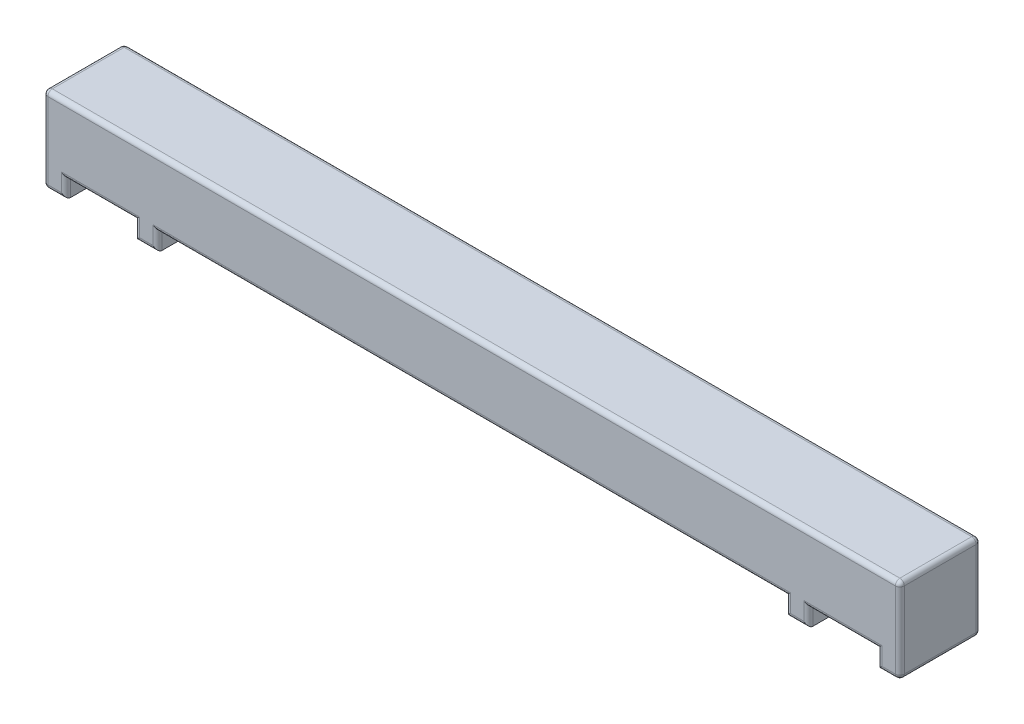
ISO-10303-21;
HEADER;
FILE_DESCRIPTION(('STEP AP214'),'2;1');
FILE_NAME('part.step','',(''),(''),'','','');
FILE_SCHEMA(('AUTOMOTIVE_DESIGN { 1 0 10303 214 1 1 1 1 }'));
ENDSEC;
DATA;
#1=APPLICATION_CONTEXT('core data for automotive mechanical design processes');
#2=APPLICATION_PROTOCOL_DEFINITION('international standard','automotive_design',2000,#1);
#3=PRODUCT_CONTEXT('',#1,'mechanical');
#4=PRODUCT('Part','Part','',(#3));
#5=PRODUCT_RELATED_PRODUCT_CATEGORY('part','',(#4));
#6=PRODUCT_DEFINITION_FORMATION('','',#4);
#7=PRODUCT_DEFINITION_CONTEXT('part definition',#1,'design');
#8=PRODUCT_DEFINITION('design','',#6,#7);
#9=PRODUCT_DEFINITION_SHAPE('','',#8);
#10=(LENGTH_UNIT() NAMED_UNIT(*) SI_UNIT(.MILLI.,.METRE.));
#11=(NAMED_UNIT(*) PLANE_ANGLE_UNIT() SI_UNIT($,.RADIAN.));
#12=(NAMED_UNIT(*) SI_UNIT($,.STERADIAN.) SOLID_ANGLE_UNIT());
#13=UNCERTAINTY_MEASURE_WITH_UNIT(LENGTH_MEASURE(1.E-05),#10,'distance_accuracy_value','');
#14=(GEOMETRIC_REPRESENTATION_CONTEXT(3) GLOBAL_UNCERTAINTY_ASSIGNED_CONTEXT((#13)) GLOBAL_UNIT_ASSIGNED_CONTEXT((#10,
#11,#12)) REPRESENTATION_CONTEXT('',''));
#15=CARTESIAN_POINT('',(0.,0.,0.));
#16=DIRECTION('',(0.,0.,1.));
#17=DIRECTION('',(1.,0.,0.));
#18=AXIS2_PLACEMENT_3D('',#15,#16,#17);
#19=CARTESIAN_POINT('',(0.,0.,0.));
#20=DIRECTION('',(0.,1.,0.));
#21=DIRECTION('',(0.,0.,1.));
#22=AXIS2_PLACEMENT_3D('',#19,#20,#21);
#23=PLANE('',#22);
#24=DIRECTION('',(0.,0.,-1.));
#25=VECTOR('',#24,1.);
#26=CARTESIAN_POINT('',(90.4,0.,9.));
#27=LINE('',#26,#25);
#28=CARTESIAN_POINT('',(90.4,0.,8.));
#29=VERTEX_POINT('',#28);
#30=CARTESIAN_POINT('',(90.4,0.,-8.));
#31=VERTEX_POINT('',#30);
#32=EDGE_CURVE('E594',#29,#31,#27,.T.);
#33=ORIENTED_EDGE('',*,*,#32,.F.);
#34=DIRECTION('',(1.,0.,0.));
#35=VECTOR('',#34,1.);
#36=CARTESIAN_POINT('',(0.,0.,8.));
#37=LINE('',#36,#35);
#38=CARTESIAN_POINT('',(75.,0.,8.));
#39=VERTEX_POINT('',#38);
#40=EDGE_CURVE('E355',#29,#39,#37,.F.);
#41=ORIENTED_EDGE('',*,*,#40,.T.);
#42=DIRECTION('',(0.,0.,1.));
#43=VECTOR('',#42,1.);
#44=CARTESIAN_POINT('',(75.,0.,9.));
#45=LINE('',#44,#43);
#46=CARTESIAN_POINT('',(75.,0.,-8.));
#47=VERTEX_POINT('',#46);
#48=EDGE_CURVE('E572',#47,#39,#45,.T.);
#49=ORIENTED_EDGE('',*,*,#48,.F.);
#50=DIRECTION('',(-1.,0.,0.));
#51=VECTOR('',#50,1.);
#52=CARTESIAN_POINT('',(0.,0.,-8.));
#53=LINE('',#52,#51);
#54=EDGE_CURVE('E353',#47,#31,#53,.F.);
#55=ORIENTED_EDGE('',*,*,#54,.T.);
#56=EDGE_LOOP('',(#33,#41,#49,#55));
#57=FACE_BOUND('',#56,.T.);
#58=ADVANCED_FACE('F38',(#57),#23,.F.);
#59=DIRECTION('',(0.,0.,-1.));
#60=VECTOR('',#59,1.);
#61=CARTESIAN_POINT('',(70.,0.,9.));
#62=LINE('',#61,#60);
#63=CARTESIAN_POINT('',(70.,0.,8.));
#64=VERTEX_POINT('',#63);
#65=CARTESIAN_POINT('',(70.,0.,-8.));
#66=VERTEX_POINT('',#65);
#67=EDGE_CURVE('E578',#64,#66,#62,.T.);
#68=ORIENTED_EDGE('',*,*,#67,.F.);
#69=DIRECTION('',(1.,0.,0.));
#70=VECTOR('',#69,1.);
#71=CARTESIAN_POINT('',(0.,0.,8.));
#72=LINE('',#71,#70);
#73=CARTESIAN_POINT('',(-70.,0.,8.));
#74=VERTEX_POINT('',#73);
#75=EDGE_CURVE('E371',#64,#74,#72,.F.);
#76=ORIENTED_EDGE('',*,*,#75,.T.);
#77=DIRECTION('',(0.,0.,1.));
#78=VECTOR('',#77,1.);
#79=CARTESIAN_POINT('',(-70.,0.,9.));
#80=LINE('',#79,#78);
#81=CARTESIAN_POINT('',(-70.,0.,-8.));
#82=VERTEX_POINT('',#81);
#83=EDGE_CURVE('E601',#82,#74,#80,.T.);
#84=ORIENTED_EDGE('',*,*,#83,.F.);
#85=DIRECTION('',(-1.,0.,0.));
#86=VECTOR('',#85,1.);
#87=CARTESIAN_POINT('',(0.,0.,-8.));
#88=LINE('',#87,#86);
#89=EDGE_CURVE('E369',#82,#66,#88,.F.);
#90=ORIENTED_EDGE('',*,*,#89,.T.);
#91=EDGE_LOOP('',(#68,#76,#84,#90));
#92=FACE_BOUND('',#91,.T.);
#93=ADVANCED_FACE('F655',(#92),#23,.F.);
#94=DIRECTION('',(0.,0.,-1.));
#95=VECTOR('',#94,1.);
#96=CARTESIAN_POINT('',(-75.,0.,9.));
#97=LINE('',#96,#95);
#98=CARTESIAN_POINT('',(-75.,0.,8.));
#99=VERTEX_POINT('',#98);
#100=CARTESIAN_POINT('',(-75.,0.,-8.));
#101=VERTEX_POINT('',#100);
#102=EDGE_CURVE('E593',#99,#101,#97,.T.);
#103=ORIENTED_EDGE('',*,*,#102,.F.);
#104=DIRECTION('',(1.,0.,0.));
#105=VECTOR('',#104,1.);
#106=CARTESIAN_POINT('',(0.,0.,8.));
#107=LINE('',#106,#105);
#108=CARTESIAN_POINT('',(-90.4,0.,8.));
#109=VERTEX_POINT('',#108);
#110=EDGE_CURVE('E387',#99,#109,#107,.F.);
#111=ORIENTED_EDGE('',*,*,#110,.T.);
#112=DIRECTION('',(0.,0.,1.));
#113=VECTOR('',#112,1.);
#114=CARTESIAN_POINT('',(-90.4,0.,9.));
#115=LINE('',#114,#113);
#116=CARTESIAN_POINT('',(-90.4,0.,-8.));
#117=VERTEX_POINT('',#116);
#118=EDGE_CURVE('E604',#117,#109,#115,.T.);
#119=ORIENTED_EDGE('',*,*,#118,.F.);
#120=DIRECTION('',(-1.,0.,0.));
#121=VECTOR('',#120,1.);
#122=CARTESIAN_POINT('',(0.,0.,-8.));
#123=LINE('',#122,#121);
#124=EDGE_CURVE('E385',#117,#101,#123,.F.);
#125=ORIENTED_EDGE('',*,*,#124,.T.);
#126=EDGE_LOOP('',(#103,#111,#119,#125));
#127=FACE_BOUND('',#126,.T.);
#128=ADVANCED_FACE('F646',(#127),#23,.F.);
#129=CARTESIAN_POINT('',(95.4,15.,-9.));
#130=DIRECTION('',(-1.,0.,0.));
#131=DIRECTION('',(0.,0.,1.));
#132=AXIS2_PLACEMENT_3D('',#129,#130,#131);
#133=PLANE('',#132);
#134=DIRECTION('',(0.,-1.,0.));
#135=VECTOR('',#134,1.);
#136=CARTESIAN_POINT('',(95.4,15.,-8.));
#137=LINE('',#136,#135);
#138=CARTESIAN_POINT('',(95.4,-3.,-8.));
#139=VERTEX_POINT('',#138);
#140=CARTESIAN_POINT('',(95.4,14.,-8.));
#141=VERTEX_POINT('',#140);
#142=EDGE_CURVE('E47',#139,#141,#137,.F.);
#143=ORIENTED_EDGE('',*,*,#142,.T.);
#144=DIRECTION('',(0.,0.,-1.));
#145=VECTOR('',#144,1.);
#146=CARTESIAN_POINT('',(95.4,14.,9.));
#147=LINE('',#146,#145);
#148=CARTESIAN_POINT('',(95.4,14.,8.));
#149=VERTEX_POINT('',#148);
#150=EDGE_CURVE('E11',#141,#149,#147,.F.);
#151=ORIENTED_EDGE('',*,*,#150,.T.);
#152=DIRECTION('',(0.,-1.,0.));
#153=VECTOR('',#152,1.);
#154=CARTESIAN_POINT('',(95.4,15.,8.));
#155=LINE('',#154,#153);
#156=CARTESIAN_POINT('',(95.4,-3.,8.));
#157=VERTEX_POINT('',#156);
#158=EDGE_CURVE('E441',#149,#157,#155,.T.);
#159=ORIENTED_EDGE('',*,*,#158,.T.);
#160=DIRECTION('',(0.,0.,1.));
#161=VECTOR('',#160,1.);
#162=CARTESIAN_POINT('',(95.4,-3.,-9.));
#163=LINE('',#162,#161);
#164=EDGE_CURVE('E58',#157,#139,#163,.F.);
#165=ORIENTED_EDGE('',*,*,#164,.T.);
#166=EDGE_LOOP('',(#143,#151,#159,#165));
#167=FACE_BOUND('',#166,.T.);
#168=ADVANCED_FACE('F643',(#167),#133,.F.);
#169=CARTESIAN_POINT('',(-95.4,15.,-9.));
#170=DIRECTION('',(0.,0.,1.));
#171=DIRECTION('',(1.,0.,0.));
#172=AXIS2_PLACEMENT_3D('',#169,#170,#171);
#173=PLANE('',#172);
#174=DIRECTION('',(0.,-1.,0.));
#175=VECTOR('',#174,1.);
#176=CARTESIAN_POINT('',(-94.4,15.,-9.));
#177=LINE('',#176,#175);
#178=CARTESIAN_POINT('',(-94.4,-3.,-9.));
#179=VERTEX_POINT('',#178);
#180=CARTESIAN_POINT('',(-94.4,14.,-9.));
#181=VERTEX_POINT('',#180);
#182=EDGE_CURVE('E436',#179,#181,#177,.F.);
#183=ORIENTED_EDGE('',*,*,#182,.T.);
#184=DIRECTION('',(-1.,0.,0.));
#185=VECTOR('',#184,1.);
#186=CARTESIAN_POINT('',(95.4,14.,-9.));
#187=LINE('',#186,#185);
#188=CARTESIAN_POINT('',(94.4,14.,-9.));
#189=VERTEX_POINT('',#188);
#190=EDGE_CURVE('E438',#181,#189,#187,.F.);
#191=ORIENTED_EDGE('',*,*,#190,.T.);
#192=DIRECTION('',(0.,-1.,0.));
#193=VECTOR('',#192,1.);
#194=CARTESIAN_POINT('',(94.4,15.,-9.));
#195=LINE('',#194,#193);
#196=CARTESIAN_POINT('',(94.4,-3.,-9.));
#197=VERTEX_POINT('',#196);
#198=EDGE_CURVE('E408',#189,#197,#195,.T.);
#199=ORIENTED_EDGE('',*,*,#198,.T.);
#200=DIRECTION('',(1.,0.,0.));
#201=VECTOR('',#200,1.);
#202=CARTESIAN_POINT('',(-95.4,-3.,-9.));
#203=LINE('',#202,#201);
#204=CARTESIAN_POINT('',(91.4,-3.,-9.));
#205=VERTEX_POINT('',#204);
#206=EDGE_CURVE('E410',#197,#205,#203,.F.);
#207=ORIENTED_EDGE('',*,*,#206,.T.);
#208=DIRECTION('',(0.,1.,0.));
#209=VECTOR('',#208,1.);
#210=CARTESIAN_POINT('',(91.4,15.,-9.));
#211=LINE('',#210,#209);
#212=CARTESIAN_POINT('',(91.4,1.,-9.));
#213=VERTEX_POINT('',#212);
#214=EDGE_CURVE('E412',#205,#213,#211,.T.);
#215=ORIENTED_EDGE('',*,*,#214,.T.);
#216=DIRECTION('',(-1.,0.,0.));
#217=VECTOR('',#216,1.);
#218=CARTESIAN_POINT('',(-95.4,1.,-9.));
#219=LINE('',#218,#217);
#220=CARTESIAN_POINT('',(74.,1.,-9.));
#221=VERTEX_POINT('',#220);
#222=EDGE_CURVE('E414',#213,#221,#219,.T.);
#223=ORIENTED_EDGE('',*,*,#222,.T.);
#224=DIRECTION('',(0.,1.,0.));
#225=VECTOR('',#224,1.);
#226=CARTESIAN_POINT('',(74.,15.,-9.));
#227=LINE('',#226,#225);
#228=CARTESIAN_POINT('',(74.,-3.,-9.));
#229=VERTEX_POINT('',#228);
#230=EDGE_CURVE('E416',#221,#229,#227,.F.);
#231=ORIENTED_EDGE('',*,*,#230,.T.);
#232=DIRECTION('',(1.,0.,0.));
#233=VECTOR('',#232,1.);
#234=CARTESIAN_POINT('',(-95.4,-3.,-9.));
#235=LINE('',#234,#233);
#236=CARTESIAN_POINT('',(71.,-3.,-9.));
#237=VERTEX_POINT('',#236);
#238=EDGE_CURVE('E418',#229,#237,#235,.F.);
#239=ORIENTED_EDGE('',*,*,#238,.T.);
#240=DIRECTION('',(0.,1.,0.));
#241=VECTOR('',#240,1.);
#242=CARTESIAN_POINT('',(71.,15.,-9.));
#243=LINE('',#242,#241);
#244=CARTESIAN_POINT('',(71.,1.,-9.));
#245=VERTEX_POINT('',#244);
#246=EDGE_CURVE('E420',#237,#245,#243,.T.);
#247=ORIENTED_EDGE('',*,*,#246,.T.);
#248=DIRECTION('',(-1.,0.,0.));
#249=VECTOR('',#248,1.);
#250=CARTESIAN_POINT('',(-95.4,1.,-9.));
#251=LINE('',#250,#249);
#252=CARTESIAN_POINT('',(-71.,1.,-9.));
#253=VERTEX_POINT('',#252);
#254=EDGE_CURVE('E422',#245,#253,#251,.T.);
#255=ORIENTED_EDGE('',*,*,#254,.T.);
#256=DIRECTION('',(0.,1.,0.));
#257=VECTOR('',#256,1.);
#258=CARTESIAN_POINT('',(-71.,15.,-9.));
#259=LINE('',#258,#257);
#260=CARTESIAN_POINT('',(-71.,-3.,-9.));
#261=VERTEX_POINT('',#260);
#262=EDGE_CURVE('E424',#253,#261,#259,.F.);
#263=ORIENTED_EDGE('',*,*,#262,.T.);
#264=DIRECTION('',(1.,0.,0.));
#265=VECTOR('',#264,1.);
#266=CARTESIAN_POINT('',(-75.,-3.,-9.));
#267=LINE('',#266,#265);
#268=CARTESIAN_POINT('',(-74.,-3.,-9.));
#269=VERTEX_POINT('',#268);
#270=EDGE_CURVE('E426',#261,#269,#267,.F.);
#271=ORIENTED_EDGE('',*,*,#270,.T.);
#272=DIRECTION('',(0.,1.,0.));
#273=VECTOR('',#272,1.);
#274=CARTESIAN_POINT('',(-74.,15.,-9.));
#275=LINE('',#274,#273);
#276=CARTESIAN_POINT('',(-74.,1.,-9.));
#277=VERTEX_POINT('',#276);
#278=EDGE_CURVE('E428',#269,#277,#275,.T.);
#279=ORIENTED_EDGE('',*,*,#278,.T.);
#280=DIRECTION('',(-1.,0.,0.));
#281=VECTOR('',#280,1.);
#282=CARTESIAN_POINT('',(-95.4,1.,-9.));
#283=LINE('',#282,#281);
#284=CARTESIAN_POINT('',(-91.4,1.,-9.));
#285=VERTEX_POINT('',#284);
#286=EDGE_CURVE('E430',#277,#285,#283,.T.);
#287=ORIENTED_EDGE('',*,*,#286,.T.);
#288=DIRECTION('',(0.,1.,0.));
#289=VECTOR('',#288,1.);
#290=CARTESIAN_POINT('',(-91.4,15.,-9.));
#291=LINE('',#290,#289);
#292=CARTESIAN_POINT('',(-91.4,-3.,-9.));
#293=VERTEX_POINT('',#292);
#294=EDGE_CURVE('E432',#285,#293,#291,.F.);
#295=ORIENTED_EDGE('',*,*,#294,.T.);
#296=DIRECTION('',(1.,0.,0.));
#297=VECTOR('',#296,1.);
#298=CARTESIAN_POINT('',(-95.4,-3.,-9.));
#299=LINE('',#298,#297);
#300=EDGE_CURVE('E434',#293,#179,#299,.F.);
#301=ORIENTED_EDGE('',*,*,#300,.T.);
#302=EDGE_LOOP('',(#183,#191,#199,#207,#215,#223,#231,#239,#247,#255,#263,#271,#279,#287,#295,#301));
#303=FACE_BOUND('',#302,.T.);
#304=ADVANCED_FACE('F645',(#303),#173,.F.);
#305=CARTESIAN_POINT('',(-95.4,15.,-9.));
#306=DIRECTION('',(1.,0.,0.));
#307=DIRECTION('',(0.,0.,-1.));
#308=AXIS2_PLACEMENT_3D('',#305,#306,#307);
#309=PLANE('',#308);
#310=DIRECTION('',(0.,-1.,0.));
#311=VECTOR('',#310,1.);
#312=CARTESIAN_POINT('',(-95.4,15.,8.));
#313=LINE('',#312,#311);
#314=CARTESIAN_POINT('',(-95.4,-3.,8.));
#315=VERTEX_POINT('',#314);
#316=CARTESIAN_POINT('',(-95.4,14.,8.));
#317=VERTEX_POINT('',#316);
#318=EDGE_CURVE('E403',#315,#317,#313,.F.);
#319=ORIENTED_EDGE('',*,*,#318,.T.);
#320=DIRECTION('',(0.,0.,1.));
#321=VECTOR('',#320,1.);
#322=CARTESIAN_POINT('',(-95.4,14.,-9.));
#323=LINE('',#322,#321);
#324=CARTESIAN_POINT('',(-95.4,14.,-8.));
#325=VERTEX_POINT('',#324);
#326=EDGE_CURVE('E405',#317,#325,#323,.F.);
#327=ORIENTED_EDGE('',*,*,#326,.T.);
#328=DIRECTION('',(0.,-1.,0.));
#329=VECTOR('',#328,1.);
#330=CARTESIAN_POINT('',(-95.4,15.,-8.));
#331=LINE('',#330,#329);
#332=CARTESIAN_POINT('',(-95.4,-3.,-8.));
#333=VERTEX_POINT('',#332);
#334=EDGE_CURVE('E399',#325,#333,#331,.T.);
#335=ORIENTED_EDGE('',*,*,#334,.T.);
#336=DIRECTION('',(0.,0.,-1.));
#337=VECTOR('',#336,1.);
#338=CARTESIAN_POINT('',(-95.4,-3.,9.));
#339=LINE('',#338,#337);
#340=EDGE_CURVE('E401',#333,#315,#339,.F.);
#341=ORIENTED_EDGE('',*,*,#340,.T.);
#342=EDGE_LOOP('',(#319,#327,#335,#341));
#343=FACE_BOUND('',#342,.T.);
#344=ADVANCED_FACE('F652',(#343),#309,.F.);
#345=CARTESIAN_POINT('',(-95.4,15.,9.));
#346=DIRECTION('',(0.,0.,-1.));
#347=DIRECTION('',(-1.,0.,0.));
#348=AXIS2_PLACEMENT_3D('',#345,#346,#347);
#349=PLANE('',#348);
#350=DIRECTION('',(1.,0.,0.));
#351=VECTOR('',#350,1.);
#352=CARTESIAN_POINT('',(-95.4,1.,9.));
#353=LINE('',#352,#351);
#354=CARTESIAN_POINT('',(74.,1.,9.));
#355=VERTEX_POINT('',#354);
#356=CARTESIAN_POINT('',(91.4,1.,9.));
#357=VERTEX_POINT('',#356);
#358=EDGE_CURVE('E338',#355,#357,#353,.T.);
#359=ORIENTED_EDGE('',*,*,#358,.T.);
#360=DIRECTION('',(0.,1.,0.));
#361=VECTOR('',#360,1.);
#362=CARTESIAN_POINT('',(91.4,15.,9.));
#363=LINE('',#362,#361);
#364=CARTESIAN_POINT('',(91.4,-3.,9.));
#365=VERTEX_POINT('',#364);
#366=EDGE_CURVE('E340',#357,#365,#363,.F.);
#367=ORIENTED_EDGE('',*,*,#366,.T.);
#368=DIRECTION('',(-1.,0.,0.));
#369=VECTOR('',#368,1.);
#370=CARTESIAN_POINT('',(-95.4,-3.,9.));
#371=LINE('',#370,#369);
#372=CARTESIAN_POINT('',(94.4,-3.,9.));
#373=VERTEX_POINT('',#372);
#374=EDGE_CURVE('E309',#365,#373,#371,.F.);
#375=ORIENTED_EDGE('',*,*,#374,.T.);
#376=DIRECTION('',(0.,-1.,0.));
#377=VECTOR('',#376,1.);
#378=CARTESIAN_POINT('',(94.4,15.,9.));
#379=LINE('',#378,#377);
#380=CARTESIAN_POINT('',(94.4,14.,9.));
#381=VERTEX_POINT('',#380);
#382=EDGE_CURVE('E307',#373,#381,#379,.F.);
#383=ORIENTED_EDGE('',*,*,#382,.T.);
#384=DIRECTION('',(1.,0.,0.));
#385=VECTOR('',#384,1.);
#386=CARTESIAN_POINT('',(-95.4,14.,9.));
#387=LINE('',#386,#385);
#388=CARTESIAN_POINT('',(-94.4,14.,9.));
#389=VERTEX_POINT('',#388);
#390=EDGE_CURVE('E278',#381,#389,#387,.F.);
#391=ORIENTED_EDGE('',*,*,#390,.T.);
#392=DIRECTION('',(0.,-1.,0.));
#393=VECTOR('',#392,1.);
#394=CARTESIAN_POINT('',(-94.4,15.,9.));
#395=LINE('',#394,#393);
#396=CARTESIAN_POINT('',(-94.4,-3.,9.));
#397=VERTEX_POINT('',#396);
#398=EDGE_CURVE('E316',#389,#397,#395,.T.);
#399=ORIENTED_EDGE('',*,*,#398,.T.);
#400=DIRECTION('',(-1.,0.,0.));
#401=VECTOR('',#400,1.);
#402=CARTESIAN_POINT('',(-90.4,-3.,9.));
#403=LINE('',#402,#401);
#404=CARTESIAN_POINT('',(-91.4,-3.,9.));
#405=VERTEX_POINT('',#404);
#406=EDGE_CURVE('E318',#397,#405,#403,.F.);
#407=ORIENTED_EDGE('',*,*,#406,.T.);
#408=DIRECTION('',(0.,1.,0.));
#409=VECTOR('',#408,1.);
#410=CARTESIAN_POINT('',(-91.4,15.,9.));
#411=LINE('',#410,#409);
#412=CARTESIAN_POINT('',(-91.4,1.,9.));
#413=VERTEX_POINT('',#412);
#414=EDGE_CURVE('E320',#405,#413,#411,.T.);
#415=ORIENTED_EDGE('',*,*,#414,.T.);
#416=DIRECTION('',(1.,0.,0.));
#417=VECTOR('',#416,1.);
#418=CARTESIAN_POINT('',(-95.4,1.,9.));
#419=LINE('',#418,#417);
#420=CARTESIAN_POINT('',(-74.,1.,9.));
#421=VERTEX_POINT('',#420);
#422=EDGE_CURVE('E322',#413,#421,#419,.T.);
#423=ORIENTED_EDGE('',*,*,#422,.T.);
#424=DIRECTION('',(0.,1.,0.));
#425=VECTOR('',#424,1.);
#426=CARTESIAN_POINT('',(-74.,15.,9.));
#427=LINE('',#426,#425);
#428=CARTESIAN_POINT('',(-74.,-3.,9.));
#429=VERTEX_POINT('',#428);
#430=EDGE_CURVE('E324',#421,#429,#427,.F.);
#431=ORIENTED_EDGE('',*,*,#430,.T.);
#432=DIRECTION('',(-1.,0.,0.));
#433=VECTOR('',#432,1.);
#434=CARTESIAN_POINT('',(-70.,-3.,9.));
#435=LINE('',#434,#433);
#436=CARTESIAN_POINT('',(-71.,-3.,9.));
#437=VERTEX_POINT('',#436);
#438=EDGE_CURVE('E326',#429,#437,#435,.F.);
#439=ORIENTED_EDGE('',*,*,#438,.T.);
#440=DIRECTION('',(0.,1.,0.));
#441=VECTOR('',#440,1.);
#442=CARTESIAN_POINT('',(-71.,15.,9.));
#443=LINE('',#442,#441);
#444=CARTESIAN_POINT('',(-71.,1.,9.));
#445=VERTEX_POINT('',#444);
#446=EDGE_CURVE('E328',#437,#445,#443,.T.);
#447=ORIENTED_EDGE('',*,*,#446,.T.);
#448=DIRECTION('',(1.,0.,0.));
#449=VECTOR('',#448,1.);
#450=CARTESIAN_POINT('',(-95.4,1.,9.));
#451=LINE('',#450,#449);
#452=CARTESIAN_POINT('',(71.,1.,9.));
#453=VERTEX_POINT('',#452);
#454=EDGE_CURVE('E330',#445,#453,#451,.T.);
#455=ORIENTED_EDGE('',*,*,#454,.T.);
#456=DIRECTION('',(0.,1.,0.));
#457=VECTOR('',#456,1.);
#458=CARTESIAN_POINT('',(71.,15.,9.));
#459=LINE('',#458,#457);
#460=CARTESIAN_POINT('',(71.,-3.,9.));
#461=VERTEX_POINT('',#460);
#462=EDGE_CURVE('E332',#453,#461,#459,.F.);
#463=ORIENTED_EDGE('',*,*,#462,.T.);
#464=DIRECTION('',(-1.,0.,0.));
#465=VECTOR('',#464,1.);
#466=CARTESIAN_POINT('',(-95.4,-3.,9.));
#467=LINE('',#466,#465);
#468=CARTESIAN_POINT('',(74.,-3.,9.));
#469=VERTEX_POINT('',#468);
#470=EDGE_CURVE('E334',#461,#469,#467,.F.);
#471=ORIENTED_EDGE('',*,*,#470,.T.);
#472=DIRECTION('',(0.,1.,0.));
#473=VECTOR('',#472,1.);
#474=CARTESIAN_POINT('',(74.,15.,9.));
#475=LINE('',#474,#473);
#476=EDGE_CURVE('E336',#469,#355,#475,.T.);
#477=ORIENTED_EDGE('',*,*,#476,.T.);
#478=EDGE_LOOP('',(#359,#367,#375,#383,#391,#399,#407,#415,#423,#431,#439,#447,#455,#463,#471,#477));
#479=FACE_BOUND('',#478,.T.);
#480=ADVANCED_FACE('F636',(#479),#349,.F.);
#481=CARTESIAN_POINT('',(0.,15.,0.));
#482=DIRECTION('',(0.,1.,0.));
#483=DIRECTION('',(0.,0.,1.));
#484=AXIS2_PLACEMENT_3D('',#481,#482,#483);
#485=PLANE('',#484);
#486=DIRECTION('',(0.,0.,1.));
#487=VECTOR('',#486,1.);
#488=CARTESIAN_POINT('',(-94.4,15.,9.));
#489=LINE('',#488,#487);
#490=CARTESIAN_POINT('',(-94.4,15.,-8.));
#491=VERTEX_POINT('',#490);
#492=CARTESIAN_POINT('',(-94.4,15.,8.));
#493=VERTEX_POINT('',#492);
#494=EDGE_CURVE('E305',#491,#493,#489,.T.);
#495=ORIENTED_EDGE('',*,*,#494,.T.);
#496=DIRECTION('',(1.,0.,0.));
#497=VECTOR('',#496,1.);
#498=CARTESIAN_POINT('',(95.4,15.,8.));
#499=LINE('',#498,#497);
#500=CARTESIAN_POINT('',(94.4,15.,8.));
#501=VERTEX_POINT('',#500);
#502=EDGE_CURVE('E276',#493,#501,#499,.T.);
#503=ORIENTED_EDGE('',*,*,#502,.T.);
#504=DIRECTION('',(0.,0.,-1.));
#505=VECTOR('',#504,1.);
#506=CARTESIAN_POINT('',(94.4,15.,-9.));
#507=LINE('',#506,#505);
#508=CARTESIAN_POINT('',(94.4,15.,-8.));
#509=VERTEX_POINT('',#508);
#510=EDGE_CURVE('E294',#501,#509,#507,.T.);
#511=ORIENTED_EDGE('',*,*,#510,.T.);
#512=DIRECTION('',(-1.,0.,0.));
#513=VECTOR('',#512,1.);
#514=CARTESIAN_POINT('',(-95.4,15.,-8.));
#515=LINE('',#514,#513);
#516=EDGE_CURVE('E300',#509,#491,#515,.T.);
#517=ORIENTED_EDGE('',*,*,#516,.T.);
#518=EDGE_LOOP('',(#495,#503,#511,#517));
#519=FACE_BOUND('',#518,.T.);
#520=ADVANCED_FACE('F303',(#519),#485,.T.);
#521=CARTESIAN_POINT('',(-90.4,-4.,9.));
#522=DIRECTION('',(-1.,0.,0.));
#523=DIRECTION('',(0.,0.,1.));
#524=AXIS2_PLACEMENT_3D('',#521,#522,#523);
#525=PLANE('',#524);
#526=ORIENTED_EDGE('',*,*,#118,.T.);
#527=DIRECTION('',(0.,1.,0.));
#528=VECTOR('',#527,1.);
#529=CARTESIAN_POINT('',(-90.4,-4.,8.));
#530=LINE('',#529,#528);
#531=CARTESIAN_POINT('',(-90.4,-4.,8.));
#532=VERTEX_POINT('',#531);
#533=EDGE_CURVE('E391',#109,#532,#530,.F.);
#534=ORIENTED_EDGE('',*,*,#533,.T.);
#535=DIRECTION('',(0.,0.,1.));
#536=VECTOR('',#535,1.);
#537=CARTESIAN_POINT('',(-90.4,-4.,9.));
#538=LINE('',#537,#536);
#539=CARTESIAN_POINT('',(-90.4,-4.,-8.));
#540=VERTEX_POINT('',#539);
#541=EDGE_CURVE('E301',#540,#532,#538,.T.);
#542=ORIENTED_EDGE('',*,*,#541,.F.);
#543=DIRECTION('',(0.,1.,0.));
#544=VECTOR('',#543,1.);
#545=CARTESIAN_POINT('',(-90.4,-4.,-8.));
#546=LINE('',#545,#544);
#547=EDGE_CURVE('E389',#540,#117,#546,.T.);
#548=ORIENTED_EDGE('',*,*,#547,.T.);
#549=EDGE_LOOP('',(#526,#534,#542,#548));
#550=FACE_BOUND('',#549,.T.);
#551=ADVANCED_FACE('F912',(#550),#525,.F.);
#552=CARTESIAN_POINT('',(0.,-4.,0.));
#553=DIRECTION('',(0.,-1.,0.));
#554=DIRECTION('',(0.,0.,-1.));
#555=AXIS2_PLACEMENT_3D('',#552,#553,#554);
#556=PLANE('',#555);
#557=ORIENTED_EDGE('',*,*,#541,.T.);
#558=DIRECTION('',(-1.,0.,0.));
#559=VECTOR('',#558,1.);
#560=CARTESIAN_POINT('',(-95.4,-4.,8.));
#561=LINE('',#560,#559);
#562=CARTESIAN_POINT('',(-94.4,-4.,8.));
#563=VERTEX_POINT('',#562);
#564=EDGE_CURVE('E397',#532,#563,#561,.T.);
#565=ORIENTED_EDGE('',*,*,#564,.T.);
#566=DIRECTION('',(0.,0.,-1.));
#567=VECTOR('',#566,1.);
#568=CARTESIAN_POINT('',(-94.4,-4.,-9.));
#569=LINE('',#568,#567);
#570=CARTESIAN_POINT('',(-94.4,-4.,-8.));
#571=VERTEX_POINT('',#570);
#572=EDGE_CURVE('E395',#563,#571,#569,.T.);
#573=ORIENTED_EDGE('',*,*,#572,.T.);
#574=DIRECTION('',(1.,0.,0.));
#575=VECTOR('',#574,1.);
#576=CARTESIAN_POINT('',(-90.4,-4.,-8.));
#577=LINE('',#576,#575);
#578=EDGE_CURVE('E393',#571,#540,#577,.T.);
#579=ORIENTED_EDGE('',*,*,#578,.T.);
#580=EDGE_LOOP('',(#557,#565,#573,#579));
#581=FACE_BOUND('',#580,.T.);
#582=ADVANCED_FACE('F909',(#581),#556,.T.);
#583=CARTESIAN_POINT('',(-75.,-4.,9.));
#584=DIRECTION('',(1.,0.,0.));
#585=DIRECTION('',(0.,0.,-1.));
#586=AXIS2_PLACEMENT_3D('',#583,#584,#585);
#587=PLANE('',#586);
#588=DIRECTION('',(0.,0.,-1.));
#589=VECTOR('',#588,1.);
#590=CARTESIAN_POINT('',(-75.,-4.,9.));
#591=LINE('',#590,#589);
#592=CARTESIAN_POINT('',(-75.,-4.,8.));
#593=VERTEX_POINT('',#592);
#594=CARTESIAN_POINT('',(-75.,-4.,-8.));
#595=VERTEX_POINT('',#594);
#596=EDGE_CURVE('E597',#593,#595,#591,.T.);
#597=ORIENTED_EDGE('',*,*,#596,.F.);
#598=DIRECTION('',(0.,1.,0.));
#599=VECTOR('',#598,1.);
#600=CARTESIAN_POINT('',(-75.,-4.,8.));
#601=LINE('',#600,#599);
#602=EDGE_CURVE('E383',#593,#99,#601,.T.);
#603=ORIENTED_EDGE('',*,*,#602,.T.);
#604=ORIENTED_EDGE('',*,*,#102,.T.);
#605=DIRECTION('',(0.,1.,0.));
#606=VECTOR('',#605,1.);
#607=CARTESIAN_POINT('',(-75.,-4.,-8.));
#608=LINE('',#607,#606);
#609=EDGE_CURVE('E381',#101,#595,#608,.F.);
#610=ORIENTED_EDGE('',*,*,#609,.T.);
#611=EDGE_LOOP('',(#597,#603,#604,#610));
#612=FACE_BOUND('',#611,.T.);
#613=ADVANCED_FACE('F923',(#612),#587,.F.);
#614=CARTESIAN_POINT('',(-70.,-4.,9.));
#615=DIRECTION('',(-1.,0.,0.));
#616=DIRECTION('',(0.,0.,1.));
#617=AXIS2_PLACEMENT_3D('',#614,#615,#616);
#618=PLANE('',#617);
#619=ORIENTED_EDGE('',*,*,#83,.T.);
#620=DIRECTION('',(0.,1.,0.));
#621=VECTOR('',#620,1.);
#622=CARTESIAN_POINT('',(-70.,-4.,8.));
#623=LINE('',#622,#621);
#624=CARTESIAN_POINT('',(-70.,-4.,8.));
#625=VERTEX_POINT('',#624);
#626=EDGE_CURVE('E375',#74,#625,#623,.F.);
#627=ORIENTED_EDGE('',*,*,#626,.T.);
#628=DIRECTION('',(0.,0.,1.));
#629=VECTOR('',#628,1.);
#630=CARTESIAN_POINT('',(-70.,-4.,9.));
#631=LINE('',#630,#629);
#632=CARTESIAN_POINT('',(-70.,-4.,-8.));
#633=VERTEX_POINT('',#632);
#634=EDGE_CURVE('E600',#633,#625,#631,.T.);
#635=ORIENTED_EDGE('',*,*,#634,.F.);
#636=DIRECTION('',(0.,1.,0.));
#637=VECTOR('',#636,1.);
#638=CARTESIAN_POINT('',(-70.,-4.,-8.));
#639=LINE('',#638,#637);
#640=EDGE_CURVE('E373',#633,#82,#639,.T.);
#641=ORIENTED_EDGE('',*,*,#640,.T.);
#642=EDGE_LOOP('',(#619,#627,#635,#641));
#643=FACE_BOUND('',#642,.T.);
#644=ADVANCED_FACE('F933',(#643),#618,.F.);
#645=CARTESIAN_POINT('',(0.,-4.,0.));
#646=DIRECTION('',(0.,-1.,0.));
#647=DIRECTION('',(0.,0.,-1.));
#648=AXIS2_PLACEMENT_3D('',#645,#646,#647);
#649=PLANE('',#648);
#650=ORIENTED_EDGE('',*,*,#634,.T.);
#651=DIRECTION('',(-1.,0.,0.));
#652=VECTOR('',#651,1.);
#653=CARTESIAN_POINT('',(-75.,-4.,8.));
#654=LINE('',#653,#652);
#655=EDGE_CURVE('E379',#625,#593,#654,.T.);
#656=ORIENTED_EDGE('',*,*,#655,.T.);
#657=ORIENTED_EDGE('',*,*,#596,.T.);
#658=DIRECTION('',(1.,0.,0.));
#659=VECTOR('',#658,1.);
#660=CARTESIAN_POINT('',(-70.,-4.,-8.));
#661=LINE('',#660,#659);
#662=EDGE_CURVE('E377',#595,#633,#661,.T.);
#663=ORIENTED_EDGE('',*,*,#662,.T.);
#664=EDGE_LOOP('',(#650,#656,#657,#663));
#665=FACE_BOUND('',#664,.T.);
#666=ADVANCED_FACE('F931',(#665),#649,.T.);
#667=CARTESIAN_POINT('',(90.4,-4.,9.));
#668=DIRECTION('',(1.,0.,0.));
#669=DIRECTION('',(0.,0.,-1.));
#670=AXIS2_PLACEMENT_3D('',#667,#668,#669);
#671=PLANE('',#670);
#672=DIRECTION('',(0.,0.,-1.));
#673=VECTOR('',#672,1.);
#674=CARTESIAN_POINT('',(90.4,-4.,9.));
#675=LINE('',#674,#673);
#676=CARTESIAN_POINT('',(90.4,-4.,8.));
#677=VERTEX_POINT('',#676);
#678=CARTESIAN_POINT('',(90.4,-4.,-8.));
#679=VERTEX_POINT('',#678);
#680=EDGE_CURVE('E590',#677,#679,#675,.T.);
#681=ORIENTED_EDGE('',*,*,#680,.F.);
#682=DIRECTION('',(0.,1.,0.));
#683=VECTOR('',#682,1.);
#684=CARTESIAN_POINT('',(90.4,-4.,8.));
#685=LINE('',#684,#683);
#686=EDGE_CURVE('E351',#677,#29,#685,.T.);
#687=ORIENTED_EDGE('',*,*,#686,.T.);
#688=ORIENTED_EDGE('',*,*,#32,.T.);
#689=DIRECTION('',(0.,1.,0.));
#690=VECTOR('',#689,1.);
#691=CARTESIAN_POINT('',(90.4,-4.,-8.));
#692=LINE('',#691,#690);
#693=EDGE_CURVE('E349',#31,#679,#692,.F.);
#694=ORIENTED_EDGE('',*,*,#693,.T.);
#695=EDGE_LOOP('',(#681,#687,#688,#694));
#696=FACE_BOUND('',#695,.T.);
#697=ADVANCED_FACE('F893',(#696),#671,.F.);
#698=CARTESIAN_POINT('',(0.,-4.,0.));
#699=DIRECTION('',(0.,1.,0.));
#700=DIRECTION('',(0.,0.,1.));
#701=AXIS2_PLACEMENT_3D('',#698,#699,#700);
#702=PLANE('',#701);
#703=DIRECTION('',(0.,0.,1.));
#704=VECTOR('',#703,1.);
#705=CARTESIAN_POINT('',(94.4,-4.,0.));
#706=LINE('',#705,#704);
#707=CARTESIAN_POINT('',(94.4,-4.,-8.));
#708=VERTEX_POINT('',#707);
#709=CARTESIAN_POINT('',(94.4,-4.,8.));
#710=VERTEX_POINT('',#709);
#711=EDGE_CURVE('E342',#708,#710,#706,.T.);
#712=ORIENTED_EDGE('',*,*,#711,.T.);
#713=DIRECTION('',(-1.,0.,0.));
#714=VECTOR('',#713,1.);
#715=CARTESIAN_POINT('',(0.,-4.,8.));
#716=LINE('',#715,#714);
#717=EDGE_CURVE('E346',#710,#677,#716,.T.);
#718=ORIENTED_EDGE('',*,*,#717,.T.);
#719=ORIENTED_EDGE('',*,*,#680,.T.);
#720=DIRECTION('',(1.,0.,0.));
#721=VECTOR('',#720,1.);
#722=CARTESIAN_POINT('',(0.,-4.,-8.));
#723=LINE('',#722,#721);
#724=EDGE_CURVE('E344',#679,#708,#723,.T.);
#725=ORIENTED_EDGE('',*,*,#724,.T.);
#726=EDGE_LOOP('',(#712,#718,#719,#725));
#727=FACE_BOUND('',#726,.T.);
#728=ADVANCED_FACE('F896',(#727),#702,.F.);
#729=CARTESIAN_POINT('',(75.,-4.,9.));
#730=DIRECTION('',(-1.,0.,0.));
#731=DIRECTION('',(0.,0.,1.));
#732=AXIS2_PLACEMENT_3D('',#729,#730,#731);
#733=PLANE('',#732);
#734=ORIENTED_EDGE('',*,*,#48,.T.);
#735=DIRECTION('',(0.,1.,0.));
#736=VECTOR('',#735,1.);
#737=CARTESIAN_POINT('',(75.,-4.,8.));
#738=LINE('',#737,#736);
#739=CARTESIAN_POINT('',(75.,-4.,8.));
#740=VERTEX_POINT('',#739);
#741=EDGE_CURVE('E359',#39,#740,#738,.F.);
#742=ORIENTED_EDGE('',*,*,#741,.T.);
#743=DIRECTION('',(0.,0.,1.));
#744=VECTOR('',#743,1.);
#745=CARTESIAN_POINT('',(75.,-4.,9.));
#746=LINE('',#745,#744);
#747=CARTESIAN_POINT('',(75.,-4.,-8.));
#748=VERTEX_POINT('',#747);
#749=EDGE_CURVE('E584',#748,#740,#746,.T.);
#750=ORIENTED_EDGE('',*,*,#749,.F.);
#751=DIRECTION('',(0.,1.,0.));
#752=VECTOR('',#751,1.);
#753=CARTESIAN_POINT('',(75.,-4.,-8.));
#754=LINE('',#753,#752);
#755=EDGE_CURVE('E357',#748,#47,#754,.T.);
#756=ORIENTED_EDGE('',*,*,#755,.T.);
#757=EDGE_LOOP('',(#734,#742,#750,#756));
#758=FACE_BOUND('',#757,.T.);
#759=ADVANCED_FACE('F882',(#758),#733,.F.);
#760=CARTESIAN_POINT('',(70.,-4.,9.));
#761=DIRECTION('',(1.,0.,0.));
#762=DIRECTION('',(0.,0.,-1.));
#763=AXIS2_PLACEMENT_3D('',#760,#761,#762);
#764=PLANE('',#763);
#765=DIRECTION('',(0.,0.,-1.));
#766=VECTOR('',#765,1.);
#767=CARTESIAN_POINT('',(70.,-4.,9.));
#768=LINE('',#767,#766);
#769=CARTESIAN_POINT('',(70.,-4.,8.));
#770=VERTEX_POINT('',#769);
#771=CARTESIAN_POINT('',(70.,-4.,-8.));
#772=VERTEX_POINT('',#771);
#773=EDGE_CURVE('E587',#770,#772,#768,.T.);
#774=ORIENTED_EDGE('',*,*,#773,.F.);
#775=DIRECTION('',(0.,1.,0.));
#776=VECTOR('',#775,1.);
#777=CARTESIAN_POINT('',(70.,-4.,8.));
#778=LINE('',#777,#776);
#779=EDGE_CURVE('E367',#770,#64,#778,.T.);
#780=ORIENTED_EDGE('',*,*,#779,.T.);
#781=ORIENTED_EDGE('',*,*,#67,.T.);
#782=DIRECTION('',(0.,1.,0.));
#783=VECTOR('',#782,1.);
#784=CARTESIAN_POINT('',(70.,-4.,-8.));
#785=LINE('',#784,#783);
#786=EDGE_CURVE('E365',#66,#772,#785,.F.);
#787=ORIENTED_EDGE('',*,*,#786,.T.);
#788=EDGE_LOOP('',(#774,#780,#781,#787));
#789=FACE_BOUND('',#788,.T.);
#790=ADVANCED_FACE('F868',(#789),#764,.F.);
#791=CARTESIAN_POINT('',(0.,-4.,0.));
#792=DIRECTION('',(0.,1.,0.));
#793=DIRECTION('',(0.,0.,1.));
#794=AXIS2_PLACEMENT_3D('',#791,#792,#793);
#795=PLANE('',#794);
#796=ORIENTED_EDGE('',*,*,#749,.T.);
#797=DIRECTION('',(-1.,0.,0.));
#798=VECTOR('',#797,1.);
#799=CARTESIAN_POINT('',(0.,-4.,8.));
#800=LINE('',#799,#798);
#801=EDGE_CURVE('E363',#740,#770,#800,.T.);
#802=ORIENTED_EDGE('',*,*,#801,.T.);
#803=ORIENTED_EDGE('',*,*,#773,.T.);
#804=DIRECTION('',(1.,0.,0.));
#805=VECTOR('',#804,1.);
#806=CARTESIAN_POINT('',(0.,-4.,-8.));
#807=LINE('',#806,#805);
#808=EDGE_CURVE('E361',#772,#748,#807,.T.);
#809=ORIENTED_EDGE('',*,*,#808,.T.);
#810=EDGE_LOOP('',(#796,#802,#803,#809));
#811=FACE_BOUND('',#810,.T.);
#812=ADVANCED_FACE('F863',(#811),#795,.F.);
#813=CARTESIAN_POINT('',(-95.4,1.,-8.));
#814=DIRECTION('',(-1.,0.,0.));
#815=DIRECTION('',(0.,0.,1.));
#816=AXIS2_PLACEMENT_3D('',#813,#814,#815);
#817=CYLINDRICAL_SURFACE('',#816,1.);
#818=CARTESIAN_POINT('',(71.,1.,-8.));
#819=DIRECTION('',(-0.707106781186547,0.707106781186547,0.));
#820=DIRECTION('',(-0.707106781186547,-0.707106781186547,0.));
#821=AXIS2_PLACEMENT_3D('',#818,#819,#820);
#822=ELLIPSE('',#821,1.41421356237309,1.);
#823=EDGE_CURVE('E565',#66,#245,#822,.F.);
#824=ORIENTED_EDGE('',*,*,#823,.F.);
#825=ORIENTED_EDGE('',*,*,#89,.F.);
#826=CARTESIAN_POINT('',(-71.,1.,-8.));
#827=DIRECTION('',(0.707106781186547,0.707106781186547,0.));
#828=DIRECTION('',(-0.707106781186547,0.707106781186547,0.));
#829=AXIS2_PLACEMENT_3D('',#826,#827,#828);
#830=ELLIPSE('',#829,1.41421356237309,1.);
#831=EDGE_CURVE('E42',#253,#82,#830,.F.);
#832=ORIENTED_EDGE('',*,*,#831,.F.);
#833=ORIENTED_EDGE('',*,*,#254,.F.);
#834=EDGE_LOOP('',(#824,#825,#832,#833));
#835=FACE_BOUND('',#834,.T.);
#836=ADVANCED_FACE('F40',(#835),#817,.T.);
#837=CARTESIAN_POINT('',(-71.,-4.,-8.));
#838=DIRECTION('',(0.,1.,0.));
#839=DIRECTION('',(0.,0.,1.));
#840=AXIS2_PLACEMENT_3D('',#837,#838,#839);
#841=CYLINDRICAL_SURFACE('',#840,1.);
#842=ORIENTED_EDGE('',*,*,#831,.T.);
#843=ORIENTED_EDGE('',*,*,#640,.F.);
#844=CARTESIAN_POINT('',(-71.,-3.,-8.));
#845=DIRECTION('',(0.707106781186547,0.707106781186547,0.));
#846=DIRECTION('',(-0.707106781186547,0.707106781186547,0.));
#847=AXIS2_PLACEMENT_3D('',#844,#845,#846);
#848=ELLIPSE('',#847,1.41421356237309,1.);
#849=EDGE_CURVE('E563',#261,#633,#848,.F.);
#850=ORIENTED_EDGE('',*,*,#849,.F.);
#851=ORIENTED_EDGE('',*,*,#262,.F.);
#852=EDGE_LOOP('',(#842,#843,#850,#851));
#853=FACE_BOUND('',#852,.T.);
#854=ADVANCED_FACE('F858',(#853),#841,.T.);
#855=CARTESIAN_POINT('',(71.,15.,-8.));
#856=DIRECTION('',(0.,1.,0.));
#857=DIRECTION('',(0.,0.,1.));
#858=AXIS2_PLACEMENT_3D('',#855,#856,#857);
#859=CYLINDRICAL_SURFACE('',#858,1.);
#860=ORIENTED_EDGE('',*,*,#823,.T.);
#861=ORIENTED_EDGE('',*,*,#246,.F.);
#862=CARTESIAN_POINT('',(71.,-3.,-8.));
#863=DIRECTION('',(0.707106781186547,-0.707106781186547,0.));
#864=DIRECTION('',(0.707106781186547,0.707106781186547,0.));
#865=AXIS2_PLACEMENT_3D('',#862,#863,#864);
#866=ELLIPSE('',#865,1.41421356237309,1.);
#867=EDGE_CURVE('E560',#772,#237,#866,.T.);
#868=ORIENTED_EDGE('',*,*,#867,.F.);
#869=ORIENTED_EDGE('',*,*,#786,.F.);
#870=EDGE_LOOP('',(#860,#861,#868,#869));
#871=FACE_BOUND('',#870,.T.);
#872=ADVANCED_FACE('F855',(#871),#859,.T.);
#873=CARTESIAN_POINT('',(0.,-3.,-8.));
#874=DIRECTION('',(-1.,0.,0.));
#875=DIRECTION('',(0.,0.,1.));
#876=AXIS2_PLACEMENT_3D('',#873,#874,#875);
#877=CYLINDRICAL_SURFACE('',#876,1.);
#878=ORIENTED_EDGE('',*,*,#849,.T.);
#879=ORIENTED_EDGE('',*,*,#662,.F.);
#880=CARTESIAN_POINT('',(-74.,-3.,-8.));
#881=DIRECTION('',(-0.707106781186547,0.707106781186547,0.));
#882=DIRECTION('',(-0.707106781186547,-0.707106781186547,0.));
#883=AXIS2_PLACEMENT_3D('',#880,#881,#882);
#884=ELLIPSE('',#883,1.41421356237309,1.);
#885=EDGE_CURVE('E554',#269,#595,#884,.T.);
#886=ORIENTED_EDGE('',*,*,#885,.F.);
#887=ORIENTED_EDGE('',*,*,#270,.F.);
#888=EDGE_LOOP('',(#878,#879,#886,#887));
#889=FACE_BOUND('',#888,.T.);
#890=ADVANCED_FACE('F851',(#889),#877,.T.);
#891=CARTESIAN_POINT('',(0.,-3.,-8.));
#892=DIRECTION('',(1.,0.,0.));
#893=DIRECTION('',(0.,0.,-1.));
#894=AXIS2_PLACEMENT_3D('',#891,#892,#893);
#895=CYLINDRICAL_SURFACE('',#894,1.);
#896=ORIENTED_EDGE('',*,*,#867,.T.);
#897=ORIENTED_EDGE('',*,*,#238,.F.);
#898=CARTESIAN_POINT('',(74.,-3.,-8.));
#899=DIRECTION('',(0.707106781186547,0.707106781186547,0.));
#900=DIRECTION('',(-0.707106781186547,0.707106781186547,0.));
#901=AXIS2_PLACEMENT_3D('',#898,#899,#900);
#902=ELLIPSE('',#901,1.41421356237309,1.);
#903=EDGE_CURVE('E551',#748,#229,#902,.T.);
#904=ORIENTED_EDGE('',*,*,#903,.F.);
#905=ORIENTED_EDGE('',*,*,#808,.F.);
#906=EDGE_LOOP('',(#896,#897,#904,#905));
#907=FACE_BOUND('',#906,.T.);
#908=ADVANCED_FACE('F848',(#907),#895,.T.);
#909=CARTESIAN_POINT('',(-95.4,1.,8.));
#910=DIRECTION('',(1.,0.,0.));
#911=DIRECTION('',(0.,0.,-1.));
#912=AXIS2_PLACEMENT_3D('',#909,#910,#911);
#913=CYLINDRICAL_SURFACE('',#912,1.);
#914=CARTESIAN_POINT('',(71.,1.,8.));
#915=DIRECTION('',(-0.707106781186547,0.707106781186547,0.));
#916=DIRECTION('',(0.707106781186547,0.707106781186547,0.));
#917=AXIS2_PLACEMENT_3D('',#914,#915,#916);
#918=ELLIPSE('',#917,1.41421356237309,1.);
#919=EDGE_CURVE('E548',#453,#64,#918,.F.);
#920=ORIENTED_EDGE('',*,*,#919,.F.);
#921=ORIENTED_EDGE('',*,*,#454,.F.);
#922=CARTESIAN_POINT('',(-71.,1.,8.));
#923=DIRECTION('',(0.707106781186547,0.707106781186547,0.));
#924=DIRECTION('',(0.707106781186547,-0.707106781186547,0.));
#925=AXIS2_PLACEMENT_3D('',#922,#923,#924);
#926=ELLIPSE('',#925,1.41421356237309,1.);
#927=EDGE_CURVE('E557',#74,#445,#926,.F.);
#928=ORIENTED_EDGE('',*,*,#927,.F.);
#929=ORIENTED_EDGE('',*,*,#75,.F.);
#930=EDGE_LOOP('',(#920,#921,#928,#929));
#931=FACE_BOUND('',#930,.T.);
#932=ADVANCED_FACE('F716',(#931),#913,.T.);
#933=CARTESIAN_POINT('',(-71.,15.,8.));
#934=DIRECTION('',(0.,1.,0.));
#935=DIRECTION('',(0.,0.,1.));
#936=AXIS2_PLACEMENT_3D('',#933,#934,#935);
#937=CYLINDRICAL_SURFACE('',#936,1.);
#938=ORIENTED_EDGE('',*,*,#927,.T.);
#939=ORIENTED_EDGE('',*,*,#446,.F.);
#940=CARTESIAN_POINT('',(-71.,-3.,8.));
#941=DIRECTION('',(0.707106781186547,0.707106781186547,0.));
#942=DIRECTION('',(0.707106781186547,-0.707106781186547,0.));
#943=AXIS2_PLACEMENT_3D('',#940,#941,#942);
#944=ELLIPSE('',#943,1.41421356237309,1.);
#945=EDGE_CURVE('E545',#625,#437,#944,.F.);
#946=ORIENTED_EDGE('',*,*,#945,.F.);
#947=ORIENTED_EDGE('',*,*,#626,.F.);
#948=EDGE_LOOP('',(#938,#939,#946,#947));
#949=FACE_BOUND('',#948,.T.);
#950=ADVANCED_FACE('F710',(#949),#937,.T.);
#951=CARTESIAN_POINT('',(-74.,15.,-8.));
#952=DIRECTION('',(0.,1.,0.));
#953=DIRECTION('',(0.,0.,1.));
#954=AXIS2_PLACEMENT_3D('',#951,#952,#953);
#955=CYLINDRICAL_SURFACE('',#954,1.);
#956=ORIENTED_EDGE('',*,*,#885,.T.);
#957=ORIENTED_EDGE('',*,*,#609,.F.);
#958=CARTESIAN_POINT('',(-74.,1.,-8.));
#959=DIRECTION('',(-0.707106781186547,0.707106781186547,0.));
#960=DIRECTION('',(-0.707106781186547,-0.707106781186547,0.));
#961=AXIS2_PLACEMENT_3D('',#958,#959,#960);
#962=ELLIPSE('',#961,1.41421356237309,1.);
#963=EDGE_CURVE('E542',#277,#101,#962,.T.);
#964=ORIENTED_EDGE('',*,*,#963,.F.);
#965=ORIENTED_EDGE('',*,*,#278,.F.);
#966=EDGE_LOOP('',(#956,#957,#964,#965));
#967=FACE_BOUND('',#966,.T.);
#968=ADVANCED_FACE('F839',(#967),#955,.T.);
#969=CARTESIAN_POINT('',(74.,-4.,-8.));
#970=DIRECTION('',(0.,1.,0.));
#971=DIRECTION('',(0.,0.,1.));
#972=AXIS2_PLACEMENT_3D('',#969,#970,#971);
#973=CYLINDRICAL_SURFACE('',#972,1.);
#974=ORIENTED_EDGE('',*,*,#903,.T.);
#975=ORIENTED_EDGE('',*,*,#230,.F.);
#976=CARTESIAN_POINT('',(74.,1.,-8.));
#977=DIRECTION('',(0.707106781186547,0.707106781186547,0.));
#978=DIRECTION('',(-0.707106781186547,0.707106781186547,0.));
#979=AXIS2_PLACEMENT_3D('',#976,#977,#978);
#980=ELLIPSE('',#979,1.41421356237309,1.);
#981=EDGE_CURVE('E539',#47,#221,#980,.T.);
#982=ORIENTED_EDGE('',*,*,#981,.F.);
#983=ORIENTED_EDGE('',*,*,#755,.F.);
#984=EDGE_LOOP('',(#974,#975,#982,#983));
#985=FACE_BOUND('',#984,.T.);
#986=ADVANCED_FACE('F836',(#985),#973,.T.);
#987=CARTESIAN_POINT('',(71.,-4.,8.));
#988=DIRECTION('',(0.,1.,0.));
#989=DIRECTION('',(0.,0.,1.));
#990=AXIS2_PLACEMENT_3D('',#987,#988,#989);
#991=CYLINDRICAL_SURFACE('',#990,1.);
#992=ORIENTED_EDGE('',*,*,#919,.T.);
#993=ORIENTED_EDGE('',*,*,#779,.F.);
#994=CARTESIAN_POINT('',(71.,-3.,8.));
#995=DIRECTION('',(-0.707106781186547,0.707106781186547,0.));
#996=DIRECTION('',(0.707106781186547,0.707106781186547,0.));
#997=AXIS2_PLACEMENT_3D('',#994,#995,#996);
#998=ELLIPSE('',#997,1.41421356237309,1.);
#999=EDGE_CURVE('E536',#461,#770,#998,.F.);
#1000=ORIENTED_EDGE('',*,*,#999,.F.);
#1001=ORIENTED_EDGE('',*,*,#462,.F.);
#1002=EDGE_LOOP('',(#992,#993,#1000,#1001));
#1003=FACE_BOUND('',#1002,.T.);
#1004=ADVANCED_FACE('F723',(#1003),#991,.T.);
#1005=CARTESIAN_POINT('',(0.,-3.,8.));
#1006=DIRECTION('',(1.,0.,0.));
#1007=DIRECTION('',(0.,0.,-1.));
#1008=AXIS2_PLACEMENT_3D('',#1005,#1006,#1007);
#1009=CYLINDRICAL_SURFACE('',#1008,1.);
#1010=ORIENTED_EDGE('',*,*,#945,.T.);
#1011=ORIENTED_EDGE('',*,*,#438,.F.);
#1012=CARTESIAN_POINT('',(-74.,-3.,8.));
#1013=DIRECTION('',(-0.707106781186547,0.707106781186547,0.));
#1014=DIRECTION('',(0.707106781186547,0.707106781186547,0.));
#1015=AXIS2_PLACEMENT_3D('',#1012,#1013,#1014);
#1016=ELLIPSE('',#1015,1.41421356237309,1.);
#1017=EDGE_CURVE('E533',#593,#429,#1016,.T.);
#1018=ORIENTED_EDGE('',*,*,#1017,.F.);
#1019=ORIENTED_EDGE('',*,*,#655,.F.);
#1020=EDGE_LOOP('',(#1010,#1011,#1018,#1019));
#1021=FACE_BOUND('',#1020,.T.);
#1022=ADVANCED_FACE('F705',(#1021),#1009,.T.);
#1023=CARTESIAN_POINT('',(-95.4,1.,-8.));
#1024=DIRECTION('',(-1.,0.,0.));
#1025=DIRECTION('',(0.,0.,1.));
#1026=AXIS2_PLACEMENT_3D('',#1023,#1024,#1025);
#1027=CYLINDRICAL_SURFACE('',#1026,1.);
#1028=ORIENTED_EDGE('',*,*,#963,.T.);
#1029=ORIENTED_EDGE('',*,*,#124,.F.);
#1030=CARTESIAN_POINT('',(-91.4,1.,-8.));
#1031=DIRECTION('',(0.707106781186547,0.707106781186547,0.));
#1032=DIRECTION('',(-0.707106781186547,0.707106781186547,0.));
#1033=AXIS2_PLACEMENT_3D('',#1030,#1031,#1032);
#1034=ELLIPSE('',#1033,1.41421356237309,1.);
#1035=EDGE_CURVE('E530',#285,#117,#1034,.F.);
#1036=ORIENTED_EDGE('',*,*,#1035,.F.);
#1037=ORIENTED_EDGE('',*,*,#286,.F.);
#1038=EDGE_LOOP('',(#1028,#1029,#1036,#1037));
#1039=FACE_BOUND('',#1038,.T.);
#1040=ADVANCED_FACE('F827',(#1039),#1027,.T.);
#1041=CARTESIAN_POINT('',(-95.4,1.,-8.));
#1042=DIRECTION('',(-1.,0.,0.));
#1043=DIRECTION('',(0.,0.,1.));
#1044=AXIS2_PLACEMENT_3D('',#1041,#1042,#1043);
#1045=CYLINDRICAL_SURFACE('',#1044,1.);
#1046=ORIENTED_EDGE('',*,*,#981,.T.);
#1047=ORIENTED_EDGE('',*,*,#222,.F.);
#1048=CARTESIAN_POINT('',(91.4,1.,-8.));
#1049=DIRECTION('',(-0.707106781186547,0.707106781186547,0.));
#1050=DIRECTION('',(-0.707106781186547,-0.707106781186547,0.));
#1051=AXIS2_PLACEMENT_3D('',#1048,#1049,#1050);
#1052=ELLIPSE('',#1051,1.41421356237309,1.);
#1053=EDGE_CURVE('E527',#31,#213,#1052,.F.);
#1054=ORIENTED_EDGE('',*,*,#1053,.F.);
#1055=ORIENTED_EDGE('',*,*,#54,.F.);
#1056=EDGE_LOOP('',(#1046,#1047,#1054,#1055));
#1057=FACE_BOUND('',#1056,.T.);
#1058=ADVANCED_FACE('F824',(#1057),#1045,.T.);
#1059=CARTESIAN_POINT('',(0.,-3.,8.));
#1060=DIRECTION('',(-1.,0.,0.));
#1061=DIRECTION('',(0.,0.,1.));
#1062=AXIS2_PLACEMENT_3D('',#1059,#1060,#1061);
#1063=CYLINDRICAL_SURFACE('',#1062,1.);
#1064=ORIENTED_EDGE('',*,*,#999,.T.);
#1065=ORIENTED_EDGE('',*,*,#801,.F.);
#1066=CARTESIAN_POINT('',(74.,-3.,8.));
#1067=DIRECTION('',(-0.707106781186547,-0.707106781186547,0.));
#1068=DIRECTION('',(-0.707106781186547,0.707106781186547,0.));
#1069=AXIS2_PLACEMENT_3D('',#1066,#1067,#1068);
#1070=ELLIPSE('',#1069,1.41421356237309,1.);
#1071=EDGE_CURVE('E524',#469,#740,#1070,.F.);
#1072=ORIENTED_EDGE('',*,*,#1071,.F.);
#1073=ORIENTED_EDGE('',*,*,#470,.F.);
#1074=EDGE_LOOP('',(#1064,#1065,#1072,#1073));
#1075=FACE_BOUND('',#1074,.T.);
#1076=ADVANCED_FACE('F726',(#1075),#1063,.T.);
#1077=CARTESIAN_POINT('',(-74.,-4.,8.));
#1078=DIRECTION('',(0.,1.,0.));
#1079=DIRECTION('',(0.,0.,1.));
#1080=AXIS2_PLACEMENT_3D('',#1077,#1078,#1079);
#1081=CYLINDRICAL_SURFACE('',#1080,1.);
#1082=ORIENTED_EDGE('',*,*,#1017,.T.);
#1083=ORIENTED_EDGE('',*,*,#430,.F.);
#1084=CARTESIAN_POINT('',(-74.,1.,8.));
#1085=DIRECTION('',(-0.707106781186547,0.707106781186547,0.));
#1086=DIRECTION('',(0.707106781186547,0.707106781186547,0.));
#1087=AXIS2_PLACEMENT_3D('',#1084,#1085,#1086);
#1088=ELLIPSE('',#1087,1.41421356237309,1.);
#1089=EDGE_CURVE('E521',#99,#421,#1088,.T.);
#1090=ORIENTED_EDGE('',*,*,#1089,.F.);
#1091=ORIENTED_EDGE('',*,*,#602,.F.);
#1092=EDGE_LOOP('',(#1082,#1083,#1090,#1091));
#1093=FACE_BOUND('',#1092,.T.);
#1094=ADVANCED_FACE('F700',(#1093),#1081,.T.);
#1095=CARTESIAN_POINT('',(-91.4,-4.,-8.));
#1096=DIRECTION('',(0.,1.,0.));
#1097=DIRECTION('',(0.,0.,1.));
#1098=AXIS2_PLACEMENT_3D('',#1095,#1096,#1097);
#1099=CYLINDRICAL_SURFACE('',#1098,1.);
#1100=ORIENTED_EDGE('',*,*,#1035,.T.);
#1101=ORIENTED_EDGE('',*,*,#547,.F.);
#1102=CARTESIAN_POINT('',(-91.4,-3.,-8.));
#1103=DIRECTION('',(0.707106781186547,0.707106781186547,0.));
#1104=DIRECTION('',(-0.707106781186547,0.707106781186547,0.));
#1105=AXIS2_PLACEMENT_3D('',#1102,#1103,#1104);
#1106=ELLIPSE('',#1105,1.41421356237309,1.);
#1107=EDGE_CURVE('E518',#293,#540,#1106,.F.);
#1108=ORIENTED_EDGE('',*,*,#1107,.F.);
#1109=ORIENTED_EDGE('',*,*,#294,.F.);
#1110=EDGE_LOOP('',(#1100,#1101,#1108,#1109));
#1111=FACE_BOUND('',#1110,.T.);
#1112=ADVANCED_FACE('F815',(#1111),#1099,.T.);
#1113=CARTESIAN_POINT('',(91.4,15.,-8.));
#1114=DIRECTION('',(0.,1.,0.));
#1115=DIRECTION('',(0.,0.,1.));
#1116=AXIS2_PLACEMENT_3D('',#1113,#1114,#1115);
#1117=CYLINDRICAL_SURFACE('',#1116,1.);
#1118=ORIENTED_EDGE('',*,*,#1053,.T.);
#1119=ORIENTED_EDGE('',*,*,#214,.F.);
#1120=CARTESIAN_POINT('',(91.4,-3.,-8.));
#1121=DIRECTION('',(0.707106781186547,-0.707106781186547,0.));
#1122=DIRECTION('',(0.707106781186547,0.707106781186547,0.));
#1123=AXIS2_PLACEMENT_3D('',#1120,#1121,#1122);
#1124=ELLIPSE('',#1123,1.41421356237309,1.);
#1125=EDGE_CURVE('E515',#679,#205,#1124,.T.);
#1126=ORIENTED_EDGE('',*,*,#1125,.F.);
#1127=ORIENTED_EDGE('',*,*,#693,.F.);
#1128=EDGE_LOOP('',(#1118,#1119,#1126,#1127));
#1129=FACE_BOUND('',#1128,.T.);
#1130=ADVANCED_FACE('F812',(#1129),#1117,.T.);
#1131=CARTESIAN_POINT('',(74.,15.,8.));
#1132=DIRECTION('',(0.,1.,0.));
#1133=DIRECTION('',(0.,0.,1.));
#1134=AXIS2_PLACEMENT_3D('',#1131,#1132,#1133);
#1135=CYLINDRICAL_SURFACE('',#1134,1.);
#1136=ORIENTED_EDGE('',*,*,#1071,.T.);
#1137=ORIENTED_EDGE('',*,*,#741,.F.);
#1138=CARTESIAN_POINT('',(74.,1.,8.));
#1139=DIRECTION('',(0.707106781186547,0.707106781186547,0.));
#1140=DIRECTION('',(0.707106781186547,-0.707106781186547,0.));
#1141=AXIS2_PLACEMENT_3D('',#1138,#1139,#1140);
#1142=ELLIPSE('',#1141,1.41421356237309,1.);
#1143=EDGE_CURVE('E512',#355,#39,#1142,.T.);
#1144=ORIENTED_EDGE('',*,*,#1143,.F.);
#1145=ORIENTED_EDGE('',*,*,#476,.F.);
#1146=EDGE_LOOP('',(#1136,#1137,#1144,#1145));
#1147=FACE_BOUND('',#1146,.T.);
#1148=ADVANCED_FACE('F730',(#1147),#1135,.T.);
#1149=CARTESIAN_POINT('',(-95.4,1.,8.));
#1150=DIRECTION('',(1.,0.,0.));
#1151=DIRECTION('',(0.,0.,-1.));
#1152=AXIS2_PLACEMENT_3D('',#1149,#1150,#1151);
#1153=CYLINDRICAL_SURFACE('',#1152,1.);
#1154=ORIENTED_EDGE('',*,*,#1089,.T.);
#1155=ORIENTED_EDGE('',*,*,#422,.F.);
#1156=CARTESIAN_POINT('',(-91.4,1.,8.));
#1157=DIRECTION('',(0.707106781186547,0.707106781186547,0.));
#1158=DIRECTION('',(0.707106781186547,-0.707106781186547,0.));
#1159=AXIS2_PLACEMENT_3D('',#1156,#1157,#1158);
#1160=ELLIPSE('',#1159,1.41421356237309,1.);
#1161=EDGE_CURVE('E509',#109,#413,#1160,.F.);
#1162=ORIENTED_EDGE('',*,*,#1161,.F.);
#1163=ORIENTED_EDGE('',*,*,#110,.F.);
#1164=EDGE_LOOP('',(#1154,#1155,#1162,#1163));
#1165=FACE_BOUND('',#1164,.T.);
#1166=ADVANCED_FACE('F695',(#1165),#1153,.T.);
#1167=CARTESIAN_POINT('',(0.,-3.,-8.));
#1168=DIRECTION('',(-1.,0.,0.));
#1169=DIRECTION('',(0.,0.,1.));
#1170=AXIS2_PLACEMENT_3D('',#1167,#1168,#1169);
#1171=CYLINDRICAL_SURFACE('',#1170,1.);
#1172=ORIENTED_EDGE('',*,*,#1107,.T.);
#1173=ORIENTED_EDGE('',*,*,#578,.F.);
#1174=CARTESIAN_POINT('',(-94.4,-3.,-8.));
#1175=DIRECTION('',(-1.,0.,0.));
#1176=DIRECTION('',(0.,0.,1.));
#1177=AXIS2_PLACEMENT_3D('',#1174,#1175,#1176);
#1178=CIRCLE('',#1177,1.);
#1179=EDGE_CURVE('E506',#179,#571,#1178,.T.);
#1180=ORIENTED_EDGE('',*,*,#1179,.F.);
#1181=ORIENTED_EDGE('',*,*,#300,.F.);
#1182=EDGE_LOOP('',(#1172,#1173,#1180,#1181));
#1183=FACE_BOUND('',#1182,.T.);
#1184=ADVANCED_FACE('F803',(#1183),#1171,.T.);
#1185=CARTESIAN_POINT('',(0.,-3.,-8.));
#1186=DIRECTION('',(1.,0.,0.));
#1187=DIRECTION('',(0.,0.,-1.));
#1188=AXIS2_PLACEMENT_3D('',#1185,#1186,#1187);
#1189=CYLINDRICAL_SURFACE('',#1188,1.);
#1190=ORIENTED_EDGE('',*,*,#1125,.T.);
#1191=ORIENTED_EDGE('',*,*,#206,.F.);
#1192=CARTESIAN_POINT('',(94.4,-3.,-8.));
#1193=DIRECTION('',(1.,0.,0.));
#1194=DIRECTION('',(0.,0.,-1.));
#1195=AXIS2_PLACEMENT_3D('',#1192,#1193,#1194);
#1196=CIRCLE('',#1195,1.);
#1197=EDGE_CURVE('E503',#708,#197,#1196,.T.);
#1198=ORIENTED_EDGE('',*,*,#1197,.F.);
#1199=ORIENTED_EDGE('',*,*,#724,.F.);
#1200=EDGE_LOOP('',(#1190,#1191,#1198,#1199));
#1201=FACE_BOUND('',#1200,.T.);
#1202=ADVANCED_FACE('F800',(#1201),#1189,.T.);
#1203=CARTESIAN_POINT('',(-95.4,1.,8.));
#1204=DIRECTION('',(1.,0.,0.));
#1205=DIRECTION('',(0.,0.,-1.));
#1206=AXIS2_PLACEMENT_3D('',#1203,#1204,#1205);
#1207=CYLINDRICAL_SURFACE('',#1206,1.);
#1208=ORIENTED_EDGE('',*,*,#1143,.T.);
#1209=ORIENTED_EDGE('',*,*,#40,.F.);
#1210=CARTESIAN_POINT('',(91.4,1.,8.));
#1211=DIRECTION('',(-0.707106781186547,0.707106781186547,0.));
#1212=DIRECTION('',(0.707106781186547,0.707106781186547,0.));
#1213=AXIS2_PLACEMENT_3D('',#1210,#1211,#1212);
#1214=ELLIPSE('',#1213,1.41421356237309,1.);
#1215=EDGE_CURVE('E500',#357,#29,#1214,.F.);
#1216=ORIENTED_EDGE('',*,*,#1215,.F.);
#1217=ORIENTED_EDGE('',*,*,#358,.F.);
#1218=EDGE_LOOP('',(#1208,#1209,#1216,#1217));
#1219=FACE_BOUND('',#1218,.T.);
#1220=ADVANCED_FACE('F737',(#1219),#1207,.T.);
#1221=CARTESIAN_POINT('',(-91.4,15.,8.));
#1222=DIRECTION('',(0.,1.,0.));
#1223=DIRECTION('',(0.,0.,1.));
#1224=AXIS2_PLACEMENT_3D('',#1221,#1222,#1223);
#1225=CYLINDRICAL_SURFACE('',#1224,1.);
#1226=ORIENTED_EDGE('',*,*,#1161,.T.);
#1227=ORIENTED_EDGE('',*,*,#414,.F.);
#1228=CARTESIAN_POINT('',(-91.4,-3.,8.));
#1229=DIRECTION('',(0.707106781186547,0.707106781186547,0.));
#1230=DIRECTION('',(0.707106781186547,-0.707106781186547,0.));
#1231=AXIS2_PLACEMENT_3D('',#1228,#1229,#1230);
#1232=ELLIPSE('',#1231,1.41421356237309,1.);
#1233=EDGE_CURVE('E497',#532,#405,#1232,.F.);
#1234=ORIENTED_EDGE('',*,*,#1233,.F.);
#1235=ORIENTED_EDGE('',*,*,#533,.F.);
#1236=EDGE_LOOP('',(#1226,#1227,#1234,#1235));
#1237=FACE_BOUND('',#1236,.T.);
#1238=ADVANCED_FACE('F690',(#1237),#1225,.T.);
#1239=CARTESIAN_POINT('',(-94.4,-3.,-8.));
#1240=DIRECTION('',(0.,0.,1.));
#1241=DIRECTION('',(1.,0.,0.));
#1242=AXIS2_PLACEMENT_3D('',#1239,#1240,#1241);
#1243=SPHERICAL_SURFACE('',#1242,1.);
#1244=CARTESIAN_POINT('',(-94.4,-3.,-8.));
#1245=DIRECTION('',(0.,-1.,0.));
#1246=DIRECTION('',(0.,0.,-1.));
#1247=AXIS2_PLACEMENT_3D('',#1244,#1245,#1246);
#1248=CIRCLE('',#1247,1.);
#1249=EDGE_CURVE('E491',#179,#333,#1248,.F.);
#1250=ORIENTED_EDGE('',*,*,#1249,.F.);
#1251=ORIENTED_EDGE('',*,*,#1179,.T.);
#1252=CARTESIAN_POINT('',(-94.4,-3.,-8.));
#1253=DIRECTION('',(0.,0.,-1.));
#1254=DIRECTION('',(-1.,0.,0.));
#1255=AXIS2_PLACEMENT_3D('',#1252,#1253,#1254);
#1256=CIRCLE('',#1255,1.);
#1257=EDGE_CURVE('E494',#333,#571,#1256,.F.);
#1258=ORIENTED_EDGE('',*,*,#1257,.F.);
#1259=EDGE_LOOP('',(#1250,#1251,#1258));
#1260=FACE_BOUND('',#1259,.T.);
#1261=ADVANCED_FACE('F792',(#1260),#1243,.T.);
#1262=CARTESIAN_POINT('',(94.4,-3.,-8.));
#1263=DIRECTION('',(0.,0.,1.));
#1264=DIRECTION('',(1.,0.,0.));
#1265=AXIS2_PLACEMENT_3D('',#1262,#1263,#1264);
#1266=SPHERICAL_SURFACE('',#1265,1.);
#1267=CARTESIAN_POINT('',(94.4,-3.,-8.));
#1268=DIRECTION('',(0.,0.,-1.));
#1269=DIRECTION('',(-1.,0.,0.));
#1270=AXIS2_PLACEMENT_3D('',#1267,#1268,#1269);
#1271=CIRCLE('',#1270,1.);
#1272=EDGE_CURVE('E486',#708,#139,#1271,.F.);
#1273=ORIENTED_EDGE('',*,*,#1272,.F.);
#1274=ORIENTED_EDGE('',*,*,#1197,.T.);
#1275=CARTESIAN_POINT('',(94.4,-3.,-8.));
#1276=DIRECTION('',(0.,-1.,0.));
#1277=DIRECTION('',(0.,0.,-1.));
#1278=AXIS2_PLACEMENT_3D('',#1275,#1276,#1277);
#1279=CIRCLE('',#1278,1.);
#1280=EDGE_CURVE('E488',#139,#197,#1279,.F.);
#1281=ORIENTED_EDGE('',*,*,#1280,.F.);
#1282=EDGE_LOOP('',(#1273,#1274,#1281));
#1283=FACE_BOUND('',#1282,.T.);
#1284=ADVANCED_FACE('F753',(#1283),#1266,.T.);
#1285=CARTESIAN_POINT('',(91.4,-4.,8.));
#1286=DIRECTION('',(0.,1.,0.));
#1287=DIRECTION('',(0.,0.,1.));
#1288=AXIS2_PLACEMENT_3D('',#1285,#1286,#1287);
#1289=CYLINDRICAL_SURFACE('',#1288,1.);
#1290=ORIENTED_EDGE('',*,*,#1215,.T.);
#1291=ORIENTED_EDGE('',*,*,#686,.F.);
#1292=CARTESIAN_POINT('',(91.4,-3.,8.));
#1293=DIRECTION('',(-0.707106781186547,0.707106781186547,0.));
#1294=DIRECTION('',(0.707106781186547,0.707106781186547,0.));
#1295=AXIS2_PLACEMENT_3D('',#1292,#1293,#1294);
#1296=ELLIPSE('',#1295,1.41421356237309,1.);
#1297=EDGE_CURVE('E484',#365,#677,#1296,.F.);
#1298=ORIENTED_EDGE('',*,*,#1297,.F.);
#1299=ORIENTED_EDGE('',*,*,#366,.F.);
#1300=EDGE_LOOP('',(#1290,#1291,#1298,#1299));
#1301=FACE_BOUND('',#1300,.T.);
#1302=ADVANCED_FACE('F740',(#1301),#1289,.T.);
#1303=CARTESIAN_POINT('',(0.,-3.,8.));
#1304=DIRECTION('',(1.,0.,0.));
#1305=DIRECTION('',(0.,0.,-1.));
#1306=AXIS2_PLACEMENT_3D('',#1303,#1304,#1305);
#1307=CYLINDRICAL_SURFACE('',#1306,1.);
#1308=ORIENTED_EDGE('',*,*,#1233,.T.);
#1309=ORIENTED_EDGE('',*,*,#406,.F.);
#1310=CARTESIAN_POINT('',(-94.4,-3.,8.));
#1311=DIRECTION('',(-1.,0.,0.));
#1312=DIRECTION('',(0.,0.,1.));
#1313=AXIS2_PLACEMENT_3D('',#1310,#1311,#1312);
#1314=CIRCLE('',#1313,1.);
#1315=EDGE_CURVE('E481',#563,#397,#1314,.T.);
#1316=ORIENTED_EDGE('',*,*,#1315,.F.);
#1317=ORIENTED_EDGE('',*,*,#564,.F.);
#1318=EDGE_LOOP('',(#1308,#1309,#1316,#1317));
#1319=FACE_BOUND('',#1318,.T.);
#1320=ADVANCED_FACE('F685',(#1319),#1307,.T.);
#1321=CARTESIAN_POINT('',(-94.4,-3.,0.));
#1322=DIRECTION('',(0.,0.,1.));
#1323=DIRECTION('',(1.,0.,0.));
#1324=AXIS2_PLACEMENT_3D('',#1321,#1322,#1323);
#1325=CYLINDRICAL_SURFACE('',#1324,1.);
#1326=ORIENTED_EDGE('',*,*,#1257,.T.);
#1327=ORIENTED_EDGE('',*,*,#572,.F.);
#1328=CARTESIAN_POINT('',(-94.4,-3.,8.));
#1329=DIRECTION('',(0.,0.,1.));
#1330=DIRECTION('',(1.,0.,0.));
#1331=AXIS2_PLACEMENT_3D('',#1328,#1329,#1330);
#1332=CIRCLE('',#1331,1.);
#1333=EDGE_CURVE('E478',#315,#563,#1332,.T.);
#1334=ORIENTED_EDGE('',*,*,#1333,.F.);
#1335=ORIENTED_EDGE('',*,*,#340,.F.);
#1336=EDGE_LOOP('',(#1326,#1327,#1334,#1335));
#1337=FACE_BOUND('',#1336,.T.);
#1338=ADVANCED_FACE('F679',(#1337),#1325,.T.);
#1339=CARTESIAN_POINT('',(-94.4,15.,-8.));
#1340=DIRECTION('',(0.,-1.,0.));
#1341=DIRECTION('',(0.,0.,-1.));
#1342=AXIS2_PLACEMENT_3D('',#1339,#1340,#1341);
#1343=CYLINDRICAL_SURFACE('',#1342,1.);
#1344=ORIENTED_EDGE('',*,*,#1249,.T.);
#1345=ORIENTED_EDGE('',*,*,#334,.F.);
#1346=CARTESIAN_POINT('',(-94.4,14.,-8.));
#1347=DIRECTION('',(0.,1.,0.));
#1348=DIRECTION('',(0.,0.,1.));
#1349=AXIS2_PLACEMENT_3D('',#1346,#1347,#1348);
#1350=CIRCLE('',#1349,1.);
#1351=EDGE_CURVE('E475',#181,#325,#1350,.T.);
#1352=ORIENTED_EDGE('',*,*,#1351,.F.);
#1353=ORIENTED_EDGE('',*,*,#182,.F.);
#1354=EDGE_LOOP('',(#1344,#1345,#1352,#1353));
#1355=FACE_BOUND('',#1354,.T.);
#1356=ADVANCED_FACE('F780',(#1355),#1343,.T.);
#1357=CARTESIAN_POINT('',(0.,14.,-8.));
#1358=DIRECTION('',(1.,0.,0.));
#1359=DIRECTION('',(0.,0.,-1.));
#1360=AXIS2_PLACEMENT_3D('',#1357,#1358,#1359);
#1361=CYLINDRICAL_SURFACE('',#1360,1.);
#1362=CARTESIAN_POINT('',(94.4,14.,-8.));
#1363=DIRECTION('',(1.,0.,0.));
#1364=DIRECTION('',(0.,0.,-1.));
#1365=AXIS2_PLACEMENT_3D('',#1362,#1363,#1364);
#1366=CIRCLE('',#1365,1.);
#1367=EDGE_CURVE('E469',#189,#509,#1366,.T.);
#1368=ORIENTED_EDGE('',*,*,#1367,.F.);
#1369=ORIENTED_EDGE('',*,*,#190,.F.);
#1370=CARTESIAN_POINT('',(-94.4,14.,-8.));
#1371=DIRECTION('',(-1.,0.,0.));
#1372=DIRECTION('',(0.,0.,1.));
#1373=AXIS2_PLACEMENT_3D('',#1370,#1371,#1372);
#1374=CIRCLE('',#1373,1.);
#1375=EDGE_CURVE('E472',#491,#181,#1374,.T.);
#1376=ORIENTED_EDGE('',*,*,#1375,.F.);
#1377=ORIENTED_EDGE('',*,*,#516,.F.);
#1378=EDGE_LOOP('',(#1368,#1369,#1376,#1377));
#1379=FACE_BOUND('',#1378,.T.);
#1380=ADVANCED_FACE('F617',(#1379),#1361,.T.);
#1381=CARTESIAN_POINT('',(94.4,15.,-8.));
#1382=DIRECTION('',(0.,-1.,0.));
#1383=DIRECTION('',(0.,0.,-1.));
#1384=AXIS2_PLACEMENT_3D('',#1381,#1382,#1383);
#1385=CYLINDRICAL_SURFACE('',#1384,1.);
#1386=ORIENTED_EDGE('',*,*,#1280,.T.);
#1387=ORIENTED_EDGE('',*,*,#198,.F.);
#1388=CARTESIAN_POINT('',(94.4,14.,-8.));
#1389=DIRECTION('',(0.,1.,0.));
#1390=DIRECTION('',(0.,0.,1.));
#1391=AXIS2_PLACEMENT_3D('',#1388,#1389,#1390);
#1392=CIRCLE('',#1391,1.);
#1393=EDGE_CURVE('E467',#141,#189,#1392,.T.);
#1394=ORIENTED_EDGE('',*,*,#1393,.F.);
#1395=ORIENTED_EDGE('',*,*,#142,.F.);
#1396=EDGE_LOOP('',(#1386,#1387,#1394,#1395));
#1397=FACE_BOUND('',#1396,.T.);
#1398=ADVANCED_FACE('F757',(#1397),#1385,.T.);
#1399=CARTESIAN_POINT('',(94.4,-3.,0.));
#1400=DIRECTION('',(0.,0.,1.));
#1401=DIRECTION('',(1.,0.,0.));
#1402=AXIS2_PLACEMENT_3D('',#1399,#1400,#1401);
#1403=CYLINDRICAL_SURFACE('',#1402,1.);
#1404=ORIENTED_EDGE('',*,*,#1272,.T.);
#1405=ORIENTED_EDGE('',*,*,#164,.F.);
#1406=CARTESIAN_POINT('',(94.4,-3.,8.));
#1407=DIRECTION('',(0.,0.,1.));
#1408=DIRECTION('',(1.,0.,0.));
#1409=AXIS2_PLACEMENT_3D('',#1406,#1407,#1408);
#1410=CIRCLE('',#1409,1.);
#1411=EDGE_CURVE('E464',#710,#157,#1410,.T.);
#1412=ORIENTED_EDGE('',*,*,#1411,.F.);
#1413=ORIENTED_EDGE('',*,*,#711,.F.);
#1414=EDGE_LOOP('',(#1404,#1405,#1412,#1413));
#1415=FACE_BOUND('',#1414,.T.);
#1416=ADVANCED_FACE('F749',(#1415),#1403,.T.);
#1417=CARTESIAN_POINT('',(0.,-3.,8.));
#1418=DIRECTION('',(-1.,0.,0.));
#1419=DIRECTION('',(0.,0.,1.));
#1420=AXIS2_PLACEMENT_3D('',#1417,#1418,#1419);
#1421=CYLINDRICAL_SURFACE('',#1420,1.);
#1422=ORIENTED_EDGE('',*,*,#1297,.T.);
#1423=ORIENTED_EDGE('',*,*,#717,.F.);
#1424=CARTESIAN_POINT('',(94.4,-3.,8.));
#1425=DIRECTION('',(1.,0.,0.));
#1426=DIRECTION('',(0.,0.,-1.));
#1427=AXIS2_PLACEMENT_3D('',#1424,#1425,#1426);
#1428=CIRCLE('',#1427,1.);
#1429=EDGE_CURVE('E461',#373,#710,#1428,.T.);
#1430=ORIENTED_EDGE('',*,*,#1429,.F.);
#1431=ORIENTED_EDGE('',*,*,#374,.F.);
#1432=EDGE_LOOP('',(#1422,#1423,#1430,#1431));
#1433=FACE_BOUND('',#1432,.T.);
#1434=ADVANCED_FACE('F743',(#1433),#1421,.T.);
#1435=CARTESIAN_POINT('',(-94.4,-3.,8.));
#1436=DIRECTION('',(0.,0.,1.));
#1437=DIRECTION('',(1.,0.,0.));
#1438=AXIS2_PLACEMENT_3D('',#1435,#1436,#1437);
#1439=SPHERICAL_SURFACE('',#1438,1.);
#1440=ORIENTED_EDGE('',*,*,#1333,.T.);
#1441=ORIENTED_EDGE('',*,*,#1315,.T.);
#1442=CARTESIAN_POINT('',(-94.4,-3.,8.));
#1443=DIRECTION('',(0.,-1.,0.));
#1444=DIRECTION('',(0.,0.,-1.));
#1445=AXIS2_PLACEMENT_3D('',#1442,#1443,#1444);
#1446=CIRCLE('',#1445,1.);
#1447=EDGE_CURVE('E458',#315,#397,#1446,.F.);
#1448=ORIENTED_EDGE('',*,*,#1447,.F.);
#1449=EDGE_LOOP('',(#1440,#1441,#1448));
#1450=FACE_BOUND('',#1449,.T.);
#1451=ADVANCED_FACE('F682',(#1450),#1439,.T.);
#1452=CARTESIAN_POINT('',(-94.4,14.,-8.));
#1453=DIRECTION('',(0.,0.,1.));
#1454=DIRECTION('',(1.,0.,0.));
#1455=AXIS2_PLACEMENT_3D('',#1452,#1453,#1454);
#1456=SPHERICAL_SURFACE('',#1455,1.);
#1457=ORIENTED_EDGE('',*,*,#1375,.T.);
#1458=ORIENTED_EDGE('',*,*,#1351,.T.);
#1459=CARTESIAN_POINT('',(-94.4,14.,-8.));
#1460=DIRECTION('',(0.,0.,-1.));
#1461=DIRECTION('',(-1.,0.,0.));
#1462=AXIS2_PLACEMENT_3D('',#1459,#1460,#1461);
#1463=CIRCLE('',#1462,1.);
#1464=EDGE_CURVE('E456',#491,#325,#1463,.F.);
#1465=ORIENTED_EDGE('',*,*,#1464,.F.);
#1466=EDGE_LOOP('',(#1457,#1458,#1465));
#1467=FACE_BOUND('',#1466,.T.);
#1468=ADVANCED_FACE('F620',(#1467),#1456,.T.);
#1469=CARTESIAN_POINT('',(94.4,14.,-8.));
#1470=DIRECTION('',(0.,0.,1.));
#1471=DIRECTION('',(1.,0.,0.));
#1472=AXIS2_PLACEMENT_3D('',#1469,#1470,#1471);
#1473=SPHERICAL_SURFACE('',#1472,1.);
#1474=ORIENTED_EDGE('',*,*,#1393,.T.);
#1475=ORIENTED_EDGE('',*,*,#1367,.T.);
#1476=CARTESIAN_POINT('',(94.4,14.,-8.));
#1477=DIRECTION('',(0.,0.,-1.));
#1478=DIRECTION('',(-1.,0.,0.));
#1479=AXIS2_PLACEMENT_3D('',#1476,#1477,#1478);
#1480=CIRCLE('',#1479,1.);
#1481=EDGE_CURVE('E297',#141,#509,#1480,.F.);
#1482=ORIENTED_EDGE('',*,*,#1481,.F.);
#1483=EDGE_LOOP('',(#1474,#1475,#1482));
#1484=FACE_BOUND('',#1483,.T.);
#1485=ADVANCED_FACE('F759',(#1484),#1473,.T.);
#1486=CARTESIAN_POINT('',(94.4,-3.,8.));
#1487=DIRECTION('',(0.,0.,1.));
#1488=DIRECTION('',(1.,0.,0.));
#1489=AXIS2_PLACEMENT_3D('',#1486,#1487,#1488);
#1490=SPHERICAL_SURFACE('',#1489,1.);
#1491=ORIENTED_EDGE('',*,*,#1429,.T.);
#1492=ORIENTED_EDGE('',*,*,#1411,.T.);
#1493=CARTESIAN_POINT('',(94.4,-3.,8.));
#1494=DIRECTION('',(0.,-1.,0.));
#1495=DIRECTION('',(0.,0.,-1.));
#1496=AXIS2_PLACEMENT_3D('',#1493,#1494,#1495);
#1497=CIRCLE('',#1496,1.);
#1498=EDGE_CURVE('E452',#373,#157,#1497,.F.);
#1499=ORIENTED_EDGE('',*,*,#1498,.F.);
#1500=EDGE_LOOP('',(#1491,#1492,#1499));
#1501=FACE_BOUND('',#1500,.T.);
#1502=ADVANCED_FACE('F746',(#1501),#1490,.T.);
#1503=CARTESIAN_POINT('',(-94.4,15.,8.));
#1504=DIRECTION('',(0.,-1.,0.));
#1505=DIRECTION('',(0.,0.,-1.));
#1506=AXIS2_PLACEMENT_3D('',#1503,#1504,#1505);
#1507=CYLINDRICAL_SURFACE('',#1506,1.);
#1508=ORIENTED_EDGE('',*,*,#1447,.T.);
#1509=ORIENTED_EDGE('',*,*,#398,.F.);
#1510=CARTESIAN_POINT('',(-94.4,14.,8.));
#1511=DIRECTION('',(0.,1.,0.));
#1512=DIRECTION('',(0.,0.,1.));
#1513=AXIS2_PLACEMENT_3D('',#1510,#1511,#1512);
#1514=CIRCLE('',#1513,1.);
#1515=EDGE_CURVE('E449',#317,#389,#1514,.T.);
#1516=ORIENTED_EDGE('',*,*,#1515,.F.);
#1517=ORIENTED_EDGE('',*,*,#318,.F.);
#1518=EDGE_LOOP('',(#1508,#1509,#1516,#1517));
#1519=FACE_BOUND('',#1518,.T.);
#1520=ADVANCED_FACE('F632',(#1519),#1507,.T.);
#1521=CARTESIAN_POINT('',(-94.4,14.,0.));
#1522=DIRECTION('',(0.,0.,-1.));
#1523=DIRECTION('',(-1.,0.,0.));
#1524=AXIS2_PLACEMENT_3D('',#1521,#1522,#1523);
#1525=CYLINDRICAL_SURFACE('',#1524,1.);
#1526=ORIENTED_EDGE('',*,*,#1464,.T.);
#1527=ORIENTED_EDGE('',*,*,#326,.F.);
#1528=CARTESIAN_POINT('',(-94.4,14.,8.));
#1529=DIRECTION('',(0.,0.,1.));
#1530=DIRECTION('',(1.,0.,0.));
#1531=AXIS2_PLACEMENT_3D('',#1528,#1529,#1530);
#1532=CIRCLE('',#1531,1.);
#1533=EDGE_CURVE('E291',#493,#317,#1532,.T.);
#1534=ORIENTED_EDGE('',*,*,#1533,.F.);
#1535=ORIENTED_EDGE('',*,*,#494,.F.);
#1536=EDGE_LOOP('',(#1526,#1527,#1534,#1535));
#1537=FACE_BOUND('',#1536,.T.);
#1538=ADVANCED_FACE('F624',(#1537),#1525,.T.);
#1539=CARTESIAN_POINT('',(94.4,14.,0.));
#1540=DIRECTION('',(0.,0.,1.));
#1541=DIRECTION('',(1.,0.,0.));
#1542=AXIS2_PLACEMENT_3D('',#1539,#1540,#1541);
#1543=CYLINDRICAL_SURFACE('',#1542,1.);
#1544=ORIENTED_EDGE('',*,*,#1481,.T.);
#1545=ORIENTED_EDGE('',*,*,#510,.F.);
#1546=CARTESIAN_POINT('',(94.4,14.,8.));
#1547=DIRECTION('',(0.,0.,1.));
#1548=DIRECTION('',(0.,-1.,0.));
#1549=AXIS2_PLACEMENT_3D('',#1546,#1547,#1548);
#1550=CIRCLE('',#1549,1.);
#1551=EDGE_CURVE('E283',#149,#501,#1550,.T.);
#1552=ORIENTED_EDGE('',*,*,#1551,.F.);
#1553=ORIENTED_EDGE('',*,*,#150,.F.);
#1554=EDGE_LOOP('',(#1544,#1545,#1552,#1553));
#1555=FACE_BOUND('',#1554,.T.);
#1556=ADVANCED_FACE('F295',(#1555),#1543,.T.);
#1557=CARTESIAN_POINT('',(94.4,15.,8.));
#1558=DIRECTION('',(0.,-1.,0.));
#1559=DIRECTION('',(0.,0.,-1.));
#1560=AXIS2_PLACEMENT_3D('',#1557,#1558,#1559);
#1561=CYLINDRICAL_SURFACE('',#1560,1.);
#1562=ORIENTED_EDGE('',*,*,#1498,.T.);
#1563=ORIENTED_EDGE('',*,*,#158,.F.);
#1564=CARTESIAN_POINT('',(94.4,14.,8.));
#1565=DIRECTION('',(0.,1.,0.));
#1566=DIRECTION('',(0.,0.,1.));
#1567=AXIS2_PLACEMENT_3D('',#1564,#1565,#1566);
#1568=CIRCLE('',#1567,1.);
#1569=EDGE_CURVE('E287',#381,#149,#1568,.T.);
#1570=ORIENTED_EDGE('',*,*,#1569,.F.);
#1571=ORIENTED_EDGE('',*,*,#382,.F.);
#1572=EDGE_LOOP('',(#1562,#1563,#1570,#1571));
#1573=FACE_BOUND('',#1572,.T.);
#1574=ADVANCED_FACE('F641',(#1573),#1561,.T.);
#1575=CARTESIAN_POINT('',(-94.4,14.,8.));
#1576=DIRECTION('',(0.,0.,1.));
#1577=DIRECTION('',(1.,0.,0.));
#1578=AXIS2_PLACEMENT_3D('',#1575,#1576,#1577);
#1579=SPHERICAL_SURFACE('',#1578,1.);
#1580=ORIENTED_EDGE('',*,*,#1533,.T.);
#1581=ORIENTED_EDGE('',*,*,#1515,.T.);
#1582=CARTESIAN_POINT('',(-94.4,14.,8.));
#1583=DIRECTION('',(-1.,0.,0.));
#1584=DIRECTION('',(0.,0.,1.));
#1585=AXIS2_PLACEMENT_3D('',#1582,#1583,#1584);
#1586=CIRCLE('',#1585,1.);
#1587=EDGE_CURVE('E280',#493,#389,#1586,.F.);
#1588=ORIENTED_EDGE('',*,*,#1587,.F.);
#1589=EDGE_LOOP('',(#1580,#1581,#1588));
#1590=FACE_BOUND('',#1589,.T.);
#1591=ADVANCED_FACE('F628',(#1590),#1579,.T.);
#1592=CARTESIAN_POINT('',(94.4,14.,8.));
#1593=DIRECTION('',(0.,0.,1.));
#1594=DIRECTION('',(1.,0.,0.));
#1595=AXIS2_PLACEMENT_3D('',#1592,#1593,#1594);
#1596=SPHERICAL_SURFACE('',#1595,1.);
#1597=ORIENTED_EDGE('',*,*,#1569,.T.);
#1598=ORIENTED_EDGE('',*,*,#1551,.T.);
#1599=CARTESIAN_POINT('',(94.4,14.,8.));
#1600=DIRECTION('',(1.,0.,0.));
#1601=DIRECTION('',(0.,0.,-1.));
#1602=AXIS2_PLACEMENT_3D('',#1599,#1600,#1601);
#1603=CIRCLE('',#1602,1.);
#1604=EDGE_CURVE('E272',#381,#501,#1603,.F.);
#1605=ORIENTED_EDGE('',*,*,#1604,.F.);
#1606=EDGE_LOOP('',(#1597,#1598,#1605));
#1607=FACE_BOUND('',#1606,.T.);
#1608=ADVANCED_FACE('F285',(#1607),#1596,.T.);
#1609=CARTESIAN_POINT('',(0.,14.,8.));
#1610=DIRECTION('',(-1.,0.,0.));
#1611=DIRECTION('',(0.,0.,1.));
#1612=AXIS2_PLACEMENT_3D('',#1609,#1610,#1611);
#1613=CYLINDRICAL_SURFACE('',#1612,1.);
#1614=ORIENTED_EDGE('',*,*,#1587,.T.);
#1615=ORIENTED_EDGE('',*,*,#390,.F.);
#1616=ORIENTED_EDGE('',*,*,#1604,.T.);
#1617=ORIENTED_EDGE('',*,*,#502,.F.);
#1618=EDGE_LOOP('',(#1614,#1615,#1616,#1617));
#1619=FACE_BOUND('',#1618,.T.);
#1620=ADVANCED_FACE('F274',(#1619),#1613,.T.);
#1621=CLOSED_SHELL('',(#58,#93,#128,#168,#304,#344,#480,#520,#551,#582,#613,#644,#666,#697,#728,
#759,#790,#812,#836,#854,#872,#890,#908,#932,#950,#968,#986,#1004,#1022,#1040,#1058,#1076,#1094,
#1112,#1130,#1148,#1166,#1184,#1202,#1220,#1238,#1261,#1284,#1302,#1320,#1338,#1356,#1380,#1398,
#1416,#1434,#1451,#1468,#1485,#1502,#1520,#1538,#1556,#1574,#1591,#1608,#1620));
#1622=MANIFOLD_SOLID_BREP('B2',#1621);
#1623=ADVANCED_BREP_SHAPE_REPRESENTATION('',(#18,#1622),#14);
#1624=SHAPE_DEFINITION_REPRESENTATION(#9,#1623);
ENDSEC;
END-ISO-10303-21;
